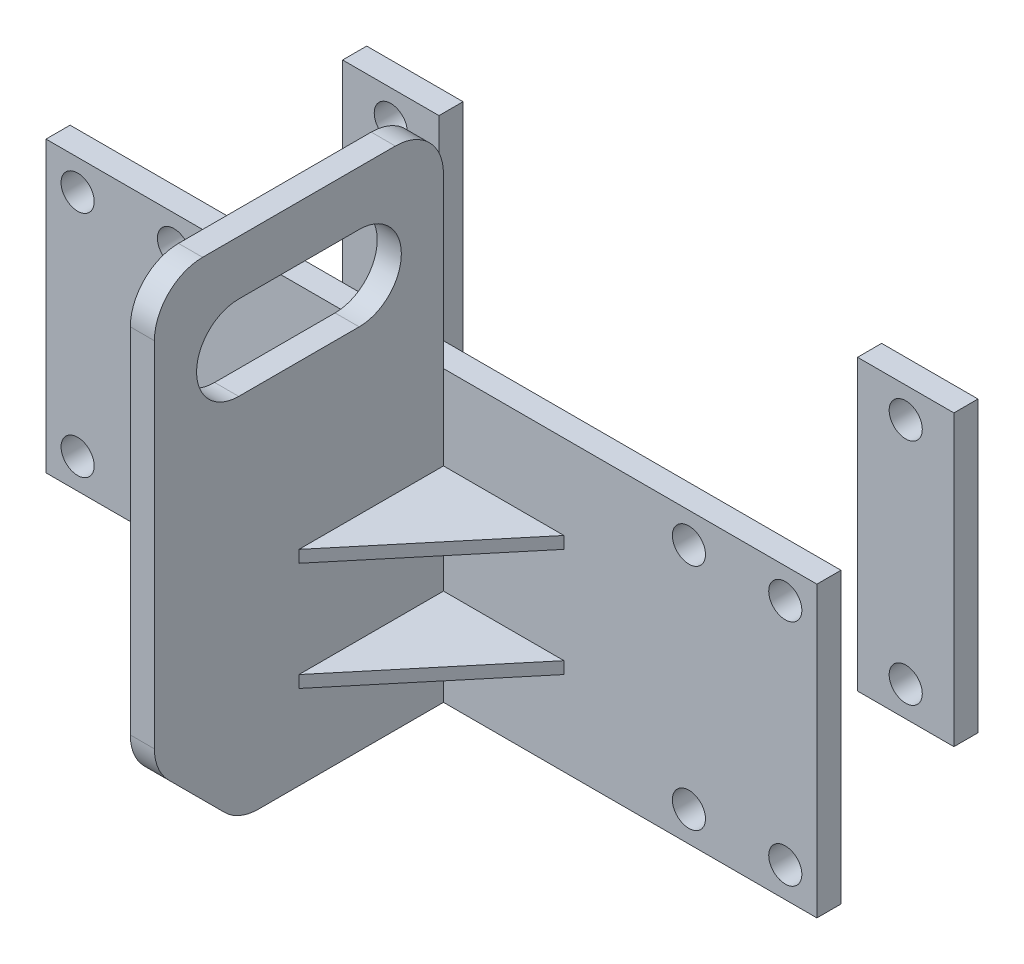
ISO-10303-21;
HEADER;
FILE_DESCRIPTION(('STEP AP214'),'2;1');
FILE_NAME('part.step','',(''),(''),'','','');
FILE_SCHEMA(('AUTOMOTIVE_DESIGN { 1 0 10303 214 1 1 1 1 }'));
ENDSEC;
DATA;
#1=APPLICATION_CONTEXT('core data for automotive mechanical design processes');
#2=APPLICATION_PROTOCOL_DEFINITION('international standard','automotive_design',2000,#1);
#3=PRODUCT_CONTEXT('',#1,'mechanical');
#4=PRODUCT('Part','Part','',(#3));
#5=PRODUCT_RELATED_PRODUCT_CATEGORY('part','',(#4));
#6=PRODUCT_DEFINITION_FORMATION('','',#4);
#7=PRODUCT_DEFINITION_CONTEXT('part definition',#1,'design');
#8=PRODUCT_DEFINITION('design','',#6,#7);
#9=PRODUCT_DEFINITION_SHAPE('','',#8);
#10=(LENGTH_UNIT() NAMED_UNIT(*) SI_UNIT(.MILLI.,.METRE.));
#11=(NAMED_UNIT(*) PLANE_ANGLE_UNIT() SI_UNIT($,.RADIAN.));
#12=(NAMED_UNIT(*) SI_UNIT($,.STERADIAN.) SOLID_ANGLE_UNIT());
#13=UNCERTAINTY_MEASURE_WITH_UNIT(LENGTH_MEASURE(1.E-05),#10,'distance_accuracy_value','');
#14=(GEOMETRIC_REPRESENTATION_CONTEXT(3) GLOBAL_UNCERTAINTY_ASSIGNED_CONTEXT((#13)) GLOBAL_UNIT_ASSIGNED_CONTEXT((#10,
#11,#12)) REPRESENTATION_CONTEXT('',''));
#15=CARTESIAN_POINT('',(0.,0.,0.));
#16=DIRECTION('',(0.,0.,1.));
#17=DIRECTION('',(1.,0.,0.));
#18=AXIS2_PLACEMENT_3D('',#15,#16,#17);
#19=CARTESIAN_POINT('',(-2387.6,0.,393.7));
#20=DIRECTION('',(0.,0.,-1.));
#21=DIRECTION('',(1.,0.,0.));
#22=AXIS2_PLACEMENT_3D('',#19,#20,#21);
#23=PLANE('',#22);
#24=CARTESIAN_POINT('',(-1058.06875,60.325000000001,393.7));
#25=DIRECTION('',(0.,0.,1.));
#26=DIRECTION('',(1.,0.,0.));
#27=AXIS2_PLACEMENT_3D('',#24,#25,#26);
#28=CIRCLE('',#27,8.73125000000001);
#29=CARTESIAN_POINT('',(-1049.3375,60.325000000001,393.7));
#30=VERTEX_POINT('',#29);
#31=EDGE_CURVE('E122',#30,#30,#28,.T.);
#32=ORIENTED_EDGE('',*,*,#31,.T.);
#33=EDGE_LOOP('',(#32));
#34=FACE_BOUND('',#33,.T.);
#35=DIRECTION('',(0.,-1.,0.));
#36=VECTOR('',#35,1.);
#37=CARTESIAN_POINT('',(-1083.46875,76.200000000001,393.7));
#38=LINE('',#37,#36);
#39=CARTESIAN_POINT('',(-1083.46875,76.200000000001,393.7));
#40=VERTEX_POINT('',#39);
#41=CARTESIAN_POINT('',(-1083.46875,-76.199999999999,393.7));
#42=VERTEX_POINT('',#41);
#43=EDGE_CURVE('E110',#40,#42,#38,.T.);
#44=ORIENTED_EDGE('',*,*,#43,.F.);
#45=DIRECTION('',(-1.,0.,0.));
#46=VECTOR('',#45,1.);
#47=CARTESIAN_POINT('',(-1083.46875,76.200000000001,393.7));
#48=LINE('',#47,#46);
#49=CARTESIAN_POINT('',(-1032.66875,76.200000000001,393.7));
#50=VERTEX_POINT('',#49);
#51=EDGE_CURVE('E113',#50,#40,#48,.T.);
#52=ORIENTED_EDGE('',*,*,#51,.F.);
#53=DIRECTION('',(0.,1.,0.));
#54=VECTOR('',#53,1.);
#55=CARTESIAN_POINT('',(-1032.66875,76.200000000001,393.7));
#56=LINE('',#55,#54);
#57=CARTESIAN_POINT('',(-1032.66875,-76.199999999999,393.7));
#58=VERTEX_POINT('',#57);
#59=EDGE_CURVE('E101',#58,#50,#56,.T.);
#60=ORIENTED_EDGE('',*,*,#59,.F.);
#61=DIRECTION('',(1.,0.,0.));
#62=VECTOR('',#61,1.);
#63=CARTESIAN_POINT('',(-1083.46875,-76.199999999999,393.7));
#64=LINE('',#63,#62);
#65=EDGE_CURVE('E106',#42,#58,#64,.T.);
#66=ORIENTED_EDGE('',*,*,#65,.F.);
#67=EDGE_LOOP('',(#44,#52,#60,#66));
#68=FACE_BOUND('',#67,.T.);
#69=CARTESIAN_POINT('',(-1058.06875,-60.324999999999,393.7));
#70=DIRECTION('',(0.,0.,1.));
#71=DIRECTION('',(1.,0.,0.));
#72=AXIS2_PLACEMENT_3D('',#69,#70,#71);
#73=CIRCLE('',#72,8.73125000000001);
#74=CARTESIAN_POINT('',(-1049.3375,-60.324999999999,393.7));
#75=VERTEX_POINT('',#74);
#76=EDGE_CURVE('E133',#75,#75,#73,.T.);
#77=ORIENTED_EDGE('',*,*,#76,.T.);
#78=EDGE_LOOP('',(#77));
#79=FACE_BOUND('',#78,.T.);
#80=ADVANCED_FACE('F54',(#34,#68,#79),#23,.T.);
#81=CARTESIAN_POINT('',(-2387.6,0.,406.4));
#82=DIRECTION('',(0.,0.,-1.));
#83=DIRECTION('',(1.,0.,0.));
#84=AXIS2_PLACEMENT_3D('',#81,#82,#83);
#85=PLANE('',#84);
#86=CARTESIAN_POINT('',(-1058.06875,60.325000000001,406.4));
#87=DIRECTION('',(0.,0.,1.));
#88=DIRECTION('',(1.,0.,0.));
#89=AXIS2_PLACEMENT_3D('',#86,#87,#88);
#90=CIRCLE('',#89,8.73125000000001);
#91=CARTESIAN_POINT('',(-1049.3375,60.325000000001,406.4));
#92=VERTEX_POINT('',#91);
#93=EDGE_CURVE('E130',#92,#92,#90,.T.);
#94=ORIENTED_EDGE('',*,*,#93,.F.);
#95=EDGE_LOOP('',(#94));
#96=FACE_BOUND('',#95,.T.);
#97=DIRECTION('',(0.,-1.,0.));
#98=VECTOR('',#97,1.);
#99=CARTESIAN_POINT('',(-1083.46875,76.200000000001,406.4));
#100=LINE('',#99,#98);
#101=CARTESIAN_POINT('',(-1083.46875,76.200000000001,406.4));
#102=VERTEX_POINT('',#101);
#103=CARTESIAN_POINT('',(-1083.46875,-76.199999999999,406.4));
#104=VERTEX_POINT('',#103);
#105=EDGE_CURVE('E118',#102,#104,#100,.T.);
#106=ORIENTED_EDGE('',*,*,#105,.T.);
#107=DIRECTION('',(1.,0.,0.));
#108=VECTOR('',#107,1.);
#109=CARTESIAN_POINT('',(-1083.46875,-76.199999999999,406.4));
#110=LINE('',#109,#108);
#111=CARTESIAN_POINT('',(-1032.66875,-76.199999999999,406.4));
#112=VERTEX_POINT('',#111);
#113=EDGE_CURVE('E121',#104,#112,#110,.T.);
#114=ORIENTED_EDGE('',*,*,#113,.T.);
#115=DIRECTION('',(0.,1.,0.));
#116=VECTOR('',#115,1.);
#117=CARTESIAN_POINT('',(-1032.66875,76.200000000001,406.4));
#118=LINE('',#117,#116);
#119=CARTESIAN_POINT('',(-1032.66875,76.200000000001,406.4));
#120=VERTEX_POINT('',#119);
#121=EDGE_CURVE('E104',#112,#120,#118,.T.);
#122=ORIENTED_EDGE('',*,*,#121,.T.);
#123=DIRECTION('',(-1.,0.,0.));
#124=VECTOR('',#123,1.);
#125=CARTESIAN_POINT('',(-1083.46875,76.200000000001,406.4));
#126=LINE('',#125,#124);
#127=EDGE_CURVE('E125',#120,#102,#126,.T.);
#128=ORIENTED_EDGE('',*,*,#127,.T.);
#129=EDGE_LOOP('',(#106,#114,#122,#128));
#130=FACE_BOUND('',#129,.T.);
#131=CARTESIAN_POINT('',(-1058.06875,-60.324999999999,406.4));
#132=DIRECTION('',(0.,0.,1.));
#133=DIRECTION('',(1.,0.,0.));
#134=AXIS2_PLACEMENT_3D('',#131,#132,#133);
#135=CIRCLE('',#134,8.73125000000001);
#136=CARTESIAN_POINT('',(-1049.3375,-60.324999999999,406.4));
#137=VERTEX_POINT('',#136);
#138=EDGE_CURVE('E136',#137,#137,#135,.T.);
#139=ORIENTED_EDGE('',*,*,#138,.F.);
#140=EDGE_LOOP('',(#139));
#141=FACE_BOUND('',#140,.T.);
#142=ADVANCED_FACE('F149',(#96,#130,#141),#85,.F.);
#143=CARTESIAN_POINT('',(-1083.46875,76.200000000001,393.7));
#144=DIRECTION('',(1.,0.,0.));
#145=DIRECTION('',(0.,0.,1.));
#146=AXIS2_PLACEMENT_3D('',#143,#144,#145);
#147=PLANE('',#146);
#148=ORIENTED_EDGE('',*,*,#105,.F.);
#149=DIRECTION('',(0.,0.,1.));
#150=VECTOR('',#149,1.);
#151=CARTESIAN_POINT('',(-1083.46875,76.200000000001,393.7));
#152=LINE('',#151,#150);
#153=EDGE_CURVE('E71',#40,#102,#152,.T.);
#154=ORIENTED_EDGE('',*,*,#153,.F.);
#155=ORIENTED_EDGE('',*,*,#43,.T.);
#156=DIRECTION('',(0.,0.,1.));
#157=VECTOR('',#156,1.);
#158=CARTESIAN_POINT('',(-1083.46875,-76.199999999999,393.7));
#159=LINE('',#158,#157);
#160=EDGE_CURVE('E13',#42,#104,#159,.T.);
#161=ORIENTED_EDGE('',*,*,#160,.T.);
#162=EDGE_LOOP('',(#148,#154,#155,#161));
#163=FACE_BOUND('',#162,.T.);
#164=ADVANCED_FACE('F56',(#163),#147,.F.);
#165=CARTESIAN_POINT('',(-1083.46875,-76.199999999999,393.7));
#166=DIRECTION('',(0.,1.,0.));
#167=DIRECTION('',(0.,0.,1.));
#168=AXIS2_PLACEMENT_3D('',#165,#166,#167);
#169=PLANE('',#168);
#170=ORIENTED_EDGE('',*,*,#113,.F.);
#171=ORIENTED_EDGE('',*,*,#160,.F.);
#172=ORIENTED_EDGE('',*,*,#65,.T.);
#173=DIRECTION('',(0.,0.,1.));
#174=VECTOR('',#173,1.);
#175=CARTESIAN_POINT('',(-1032.66875,-76.199999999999,393.7));
#176=LINE('',#175,#174);
#177=EDGE_CURVE('E63',#58,#112,#176,.T.);
#178=ORIENTED_EDGE('',*,*,#177,.T.);
#179=EDGE_LOOP('',(#170,#171,#172,#178));
#180=FACE_BOUND('',#179,.T.);
#181=ADVANCED_FACE('F107',(#180),#169,.F.);
#182=CARTESIAN_POINT('',(-1032.66875,76.200000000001,393.7));
#183=DIRECTION('',(-1.,0.,0.));
#184=DIRECTION('',(0.,0.,-1.));
#185=AXIS2_PLACEMENT_3D('',#182,#183,#184);
#186=PLANE('',#185);
#187=ORIENTED_EDGE('',*,*,#121,.F.);
#188=ORIENTED_EDGE('',*,*,#177,.F.);
#189=ORIENTED_EDGE('',*,*,#59,.T.);
#190=DIRECTION('',(0.,0.,1.));
#191=VECTOR('',#190,1.);
#192=CARTESIAN_POINT('',(-1032.66875,76.200000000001,393.7));
#193=LINE('',#192,#191);
#194=EDGE_CURVE('E87',#50,#120,#193,.T.);
#195=ORIENTED_EDGE('',*,*,#194,.T.);
#196=EDGE_LOOP('',(#187,#188,#189,#195));
#197=FACE_BOUND('',#196,.T.);
#198=ADVANCED_FACE('F99',(#197),#186,.F.);
#199=CARTESIAN_POINT('',(-1083.46875,76.200000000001,393.7));
#200=DIRECTION('',(0.,-1.,0.));
#201=DIRECTION('',(0.,0.,-1.));
#202=AXIS2_PLACEMENT_3D('',#199,#200,#201);
#203=PLANE('',#202);
#204=ORIENTED_EDGE('',*,*,#127,.F.);
#205=ORIENTED_EDGE('',*,*,#194,.F.);
#206=ORIENTED_EDGE('',*,*,#51,.T.);
#207=ORIENTED_EDGE('',*,*,#153,.T.);
#208=EDGE_LOOP('',(#204,#205,#206,#207));
#209=FACE_BOUND('',#208,.T.);
#210=ADVANCED_FACE('F162',(#209),#203,.F.);
#211=CARTESIAN_POINT('',(-1058.06875,60.325000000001,393.7));
#212=DIRECTION('',(0.,0.,1.));
#213=DIRECTION('',(-1.,0.,0.));
#214=AXIS2_PLACEMENT_3D('',#211,#212,#213);
#215=CYLINDRICAL_SURFACE('',#214,8.73125000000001);
#216=ORIENTED_EDGE('',*,*,#31,.F.);
#217=EDGE_LOOP('',(#216));
#218=FACE_BOUND('',#217,.T.);
#219=ORIENTED_EDGE('',*,*,#93,.T.);
#220=EDGE_LOOP('',(#219));
#221=FACE_BOUND('',#220,.T.);
#222=ADVANCED_FACE('F145',(#218,#221),#215,.F.);
#223=CARTESIAN_POINT('',(-1058.06875,-60.324999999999,393.7));
#224=DIRECTION('',(0.,0.,1.));
#225=DIRECTION('',(-1.,0.,0.));
#226=AXIS2_PLACEMENT_3D('',#223,#224,#225);
#227=CYLINDRICAL_SURFACE('',#226,8.73125000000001);
#228=ORIENTED_EDGE('',*,*,#76,.F.);
#229=EDGE_LOOP('',(#228));
#230=FACE_BOUND('',#229,.T.);
#231=ORIENTED_EDGE('',*,*,#138,.T.);
#232=EDGE_LOOP('',(#231));
#233=FACE_BOUND('',#232,.T.);
#234=ADVANCED_FACE('F142',(#230,#233),#227,.F.);
#235=CLOSED_SHELL('',(#80,#142,#164,#181,#198,#210,#222,#234));
#236=MANIFOLD_SOLID_BREP('B2',#235);
#237=CARTESIAN_POINT('',(0.,0.,393.7));
#238=DIRECTION('',(0.,0.,-1.));
#239=DIRECTION('',(-1.,0.,0.));
#240=AXIS2_PLACEMENT_3D('',#237,#238,#239);
#241=PLANE('',#240);
#242=CARTESIAN_POINT('',(-1329.53125,60.325000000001,393.7));
#243=DIRECTION('',(0.,0.,-1.));
#244=DIRECTION('',(-1.,0.,0.));
#245=AXIS2_PLACEMENT_3D('',#242,#243,#244);
#246=CIRCLE('',#245,8.73125000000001);
#247=CARTESIAN_POINT('',(-1338.2625,60.325000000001,393.7));
#248=VERTEX_POINT('',#247);
#249=EDGE_CURVE('E297',#248,#248,#246,.T.);
#250=ORIENTED_EDGE('',*,*,#249,.F.);
#251=EDGE_LOOP('',(#250));
#252=FACE_BOUND('',#251,.T.);
#253=DIRECTION('',(0.,-1.,0.));
#254=VECTOR('',#253,1.);
#255=CARTESIAN_POINT('',(-1304.13125,76.200000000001,393.7));
#256=LINE('',#255,#254);
#257=CARTESIAN_POINT('',(-1304.13125,76.200000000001,393.7));
#258=VERTEX_POINT('',#257);
#259=CARTESIAN_POINT('',(-1304.13125,-76.199999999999,393.7));
#260=VERTEX_POINT('',#259);
#261=EDGE_CURVE('E282',#258,#260,#256,.T.);
#262=ORIENTED_EDGE('',*,*,#261,.T.);
#263=DIRECTION('',(-1.,0.,0.));
#264=VECTOR('',#263,1.);
#265=CARTESIAN_POINT('',(-1304.13125,-76.199999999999,393.7));
#266=LINE('',#265,#264);
#267=CARTESIAN_POINT('',(-1354.93125,-76.199999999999,393.7));
#268=VERTEX_POINT('',#267);
#269=EDGE_CURVE('E277',#260,#268,#266,.T.);
#270=ORIENTED_EDGE('',*,*,#269,.T.);
#271=DIRECTION('',(0.,1.,0.));
#272=VECTOR('',#271,1.);
#273=CARTESIAN_POINT('',(-1354.93125,76.200000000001,393.7));
#274=LINE('',#273,#272);
#275=CARTESIAN_POINT('',(-1354.93125,76.200000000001,393.7));
#276=VERTEX_POINT('',#275);
#277=EDGE_CURVE('E280',#268,#276,#274,.T.);
#278=ORIENTED_EDGE('',*,*,#277,.T.);
#279=DIRECTION('',(1.,0.,0.));
#280=VECTOR('',#279,1.);
#281=CARTESIAN_POINT('',(-1304.13125,76.200000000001,393.7));
#282=LINE('',#281,#280);
#283=EDGE_CURVE('E247',#276,#258,#282,.T.);
#284=ORIENTED_EDGE('',*,*,#283,.T.);
#285=EDGE_LOOP('',(#262,#270,#278,#284));
#286=FACE_BOUND('',#285,.T.);
#287=CARTESIAN_POINT('',(-1329.53125,-60.324999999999,393.7));
#288=DIRECTION('',(0.,0.,-1.));
#289=DIRECTION('',(-1.,0.,0.));
#290=AXIS2_PLACEMENT_3D('',#287,#288,#289);
#291=CIRCLE('',#290,8.73125000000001);
#292=CARTESIAN_POINT('',(-1338.2625,-60.324999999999,393.7));
#293=VERTEX_POINT('',#292);
#294=EDGE_CURVE('E312',#293,#293,#291,.T.);
#295=ORIENTED_EDGE('',*,*,#294,.F.);
#296=EDGE_LOOP('',(#295));
#297=FACE_BOUND('',#296,.T.);
#298=ADVANCED_FACE('F230',(#252,#286,#297),#241,.T.);
#299=CARTESIAN_POINT('',(0.,0.,406.4));
#300=DIRECTION('',(0.,0.,-1.));
#301=DIRECTION('',(-1.,0.,0.));
#302=AXIS2_PLACEMENT_3D('',#299,#300,#301);
#303=PLANE('',#302);
#304=CARTESIAN_POINT('',(-1329.53125,60.325000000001,406.4));
#305=DIRECTION('',(0.,0.,-1.));
#306=DIRECTION('',(-1.,0.,0.));
#307=AXIS2_PLACEMENT_3D('',#304,#305,#306);
#308=CIRCLE('',#307,8.73125000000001);
#309=CARTESIAN_POINT('',(-1338.2625,60.325000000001,406.4));
#310=VERTEX_POINT('',#309);
#311=EDGE_CURVE('E309',#310,#310,#308,.T.);
#312=ORIENTED_EDGE('',*,*,#311,.T.);
#313=EDGE_LOOP('',(#312));
#314=FACE_BOUND('',#313,.T.);
#315=DIRECTION('',(0.,-1.,0.));
#316=VECTOR('',#315,1.);
#317=CARTESIAN_POINT('',(-1304.13125,76.200000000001,406.4));
#318=LINE('',#317,#316);
#319=CARTESIAN_POINT('',(-1304.13125,76.200000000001,406.4));
#320=VERTEX_POINT('',#319);
#321=CARTESIAN_POINT('',(-1304.13125,-76.199999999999,406.4));
#322=VERTEX_POINT('',#321);
#323=EDGE_CURVE('E294',#320,#322,#318,.T.);
#324=ORIENTED_EDGE('',*,*,#323,.F.);
#325=DIRECTION('',(1.,0.,0.));
#326=VECTOR('',#325,1.);
#327=CARTESIAN_POINT('',(-1304.13125,76.200000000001,406.4));
#328=LINE('',#327,#326);
#329=CARTESIAN_POINT('',(-1354.93125,76.200000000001,406.4));
#330=VERTEX_POINT('',#329);
#331=EDGE_CURVE('E270',#330,#320,#328,.T.);
#332=ORIENTED_EDGE('',*,*,#331,.F.);
#333=DIRECTION('',(0.,1.,0.));
#334=VECTOR('',#333,1.);
#335=CARTESIAN_POINT('',(-1354.93125,76.200000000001,406.4));
#336=LINE('',#335,#334);
#337=CARTESIAN_POINT('',(-1354.93125,-76.199999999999,406.4));
#338=VERTEX_POINT('',#337);
#339=EDGE_CURVE('E264',#338,#330,#336,.T.);
#340=ORIENTED_EDGE('',*,*,#339,.F.);
#341=DIRECTION('',(-1.,0.,0.));
#342=VECTOR('',#341,1.);
#343=CARTESIAN_POINT('',(-1304.13125,-76.199999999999,406.4));
#344=LINE('',#343,#342);
#345=EDGE_CURVE('E286',#322,#338,#344,.T.);
#346=ORIENTED_EDGE('',*,*,#345,.F.);
#347=EDGE_LOOP('',(#324,#332,#340,#346));
#348=FACE_BOUND('',#347,.T.);
#349=CARTESIAN_POINT('',(-1329.53125,-60.324999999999,406.4));
#350=DIRECTION('',(0.,0.,-1.));
#351=DIRECTION('',(-1.,0.,0.));
#352=AXIS2_PLACEMENT_3D('',#349,#350,#351);
#353=CIRCLE('',#352,8.73125000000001);
#354=CARTESIAN_POINT('',(-1338.2625,-60.324999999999,406.4));
#355=VERTEX_POINT('',#354);
#356=EDGE_CURVE('E315',#355,#355,#353,.T.);
#357=ORIENTED_EDGE('',*,*,#356,.T.);
#358=EDGE_LOOP('',(#357));
#359=FACE_BOUND('',#358,.T.);
#360=ADVANCED_FACE('F305',(#314,#348,#359),#303,.F.);
#361=CARTESIAN_POINT('',(-1304.13125,76.200000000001,393.7));
#362=DIRECTION('',(-1.,0.,0.));
#363=DIRECTION('',(0.,0.,1.));
#364=AXIS2_PLACEMENT_3D('',#361,#362,#363);
#365=PLANE('',#364);
#366=ORIENTED_EDGE('',*,*,#323,.T.);
#367=DIRECTION('',(0.,0.,1.));
#368=VECTOR('',#367,1.);
#369=CARTESIAN_POINT('',(-1304.13125,-76.199999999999,393.7));
#370=LINE('',#369,#368);
#371=EDGE_CURVE('E52',#260,#322,#370,.T.);
#372=ORIENTED_EDGE('',*,*,#371,.F.);
#373=ORIENTED_EDGE('',*,*,#261,.F.);
#374=DIRECTION('',(0.,0.,1.));
#375=VECTOR('',#374,1.);
#376=CARTESIAN_POINT('',(-1304.13125,76.200000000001,393.7));
#377=LINE('',#376,#375);
#378=EDGE_CURVE('E290',#258,#320,#377,.T.);
#379=ORIENTED_EDGE('',*,*,#378,.T.);
#380=EDGE_LOOP('',(#366,#372,#373,#379));
#381=FACE_BOUND('',#380,.T.);
#382=ADVANCED_FACE('F232',(#381),#365,.F.);
#383=CARTESIAN_POINT('',(-1304.13125,-76.199999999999,393.7));
#384=DIRECTION('',(0.,1.,0.));
#385=DIRECTION('',(0.,0.,1.));
#386=AXIS2_PLACEMENT_3D('',#383,#384,#385);
#387=PLANE('',#386);
#388=ORIENTED_EDGE('',*,*,#345,.T.);
#389=DIRECTION('',(0.,0.,1.));
#390=VECTOR('',#389,1.);
#391=CARTESIAN_POINT('',(-1354.93125,-76.199999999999,393.7));
#392=LINE('',#391,#390);
#393=EDGE_CURVE('E239',#268,#338,#392,.T.);
#394=ORIENTED_EDGE('',*,*,#393,.F.);
#395=ORIENTED_EDGE('',*,*,#269,.F.);
#396=ORIENTED_EDGE('',*,*,#371,.T.);
#397=EDGE_LOOP('',(#388,#394,#395,#396));
#398=FACE_BOUND('',#397,.T.);
#399=ADVANCED_FACE('F285',(#398),#387,.F.);
#400=CARTESIAN_POINT('',(-1354.93125,76.200000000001,393.7));
#401=DIRECTION('',(1.,0.,0.));
#402=DIRECTION('',(0.,0.,-1.));
#403=AXIS2_PLACEMENT_3D('',#400,#401,#402);
#404=PLANE('',#403);
#405=ORIENTED_EDGE('',*,*,#339,.T.);
#406=DIRECTION('',(0.,0.,1.));
#407=VECTOR('',#406,1.);
#408=CARTESIAN_POINT('',(-1354.93125,76.200000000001,393.7));
#409=LINE('',#408,#407);
#410=EDGE_CURVE('E287',#276,#330,#409,.T.);
#411=ORIENTED_EDGE('',*,*,#410,.F.);
#412=ORIENTED_EDGE('',*,*,#277,.F.);
#413=ORIENTED_EDGE('',*,*,#393,.T.);
#414=EDGE_LOOP('',(#405,#411,#412,#413));
#415=FACE_BOUND('',#414,.T.);
#416=ADVANCED_FACE('F288',(#415),#404,.F.);
#417=CARTESIAN_POINT('',(-1304.13125,76.200000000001,393.7));
#418=DIRECTION('',(0.,-1.,0.));
#419=DIRECTION('',(0.,0.,-1.));
#420=AXIS2_PLACEMENT_3D('',#417,#418,#419);
#421=PLANE('',#420);
#422=ORIENTED_EDGE('',*,*,#331,.T.);
#423=ORIENTED_EDGE('',*,*,#378,.F.);
#424=ORIENTED_EDGE('',*,*,#283,.F.);
#425=ORIENTED_EDGE('',*,*,#410,.T.);
#426=EDGE_LOOP('',(#422,#423,#424,#425));
#427=FACE_BOUND('',#426,.T.);
#428=ADVANCED_FACE('F302',(#427),#421,.F.);
#429=CARTESIAN_POINT('',(-1329.53125,60.325000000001,393.7));
#430=DIRECTION('',(0.,0.,1.));
#431=DIRECTION('',(1.,0.,0.));
#432=AXIS2_PLACEMENT_3D('',#429,#430,#431);
#433=CYLINDRICAL_SURFACE('',#432,8.73125000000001);
#434=ORIENTED_EDGE('',*,*,#249,.T.);
#435=EDGE_LOOP('',(#434));
#436=FACE_BOUND('',#435,.T.);
#437=ORIENTED_EDGE('',*,*,#311,.F.);
#438=EDGE_LOOP('',(#437));
#439=FACE_BOUND('',#438,.T.);
#440=ADVANCED_FACE('F333',(#436,#439),#433,.F.);
#441=CARTESIAN_POINT('',(-1329.53125,-60.324999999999,393.7));
#442=DIRECTION('',(0.,0.,1.));
#443=DIRECTION('',(1.,0.,0.));
#444=AXIS2_PLACEMENT_3D('',#441,#442,#443);
#445=CYLINDRICAL_SURFACE('',#444,8.73125000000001);
#446=ORIENTED_EDGE('',*,*,#294,.T.);
#447=EDGE_LOOP('',(#446));
#448=FACE_BOUND('',#447,.T.);
#449=ORIENTED_EDGE('',*,*,#356,.F.);
#450=EDGE_LOOP('',(#449));
#451=FACE_BOUND('',#450,.T.);
#452=ADVANCED_FACE('F321',(#448,#451),#445,.F.);
#453=CLOSED_SHELL('',(#298,#360,#382,#399,#416,#428,#440,#452));
#454=MANIFOLD_SOLID_BREP('B7',#453);
#455=CARTESIAN_POINT('',(-1417.32,-69.849999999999,520.7));
#456=DIRECTION('',(0.,0.,1.));
#457=DIRECTION('',(1.,0.,0.));
#458=AXIS2_PLACEMENT_3D('',#455,#456,#457);
#459=PLANE('',#458);
#460=CARTESIAN_POINT('',(-1380.33125,-60.324999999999,520.7));
#461=DIRECTION('',(0.,0.,-1.));
#462=DIRECTION('',(-1.,0.,0.));
#463=AXIS2_PLACEMENT_3D('',#460,#461,#462);
#464=CIRCLE('',#463,8.73125000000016);
#465=CARTESIAN_POINT('',(-1389.0625,-60.324999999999,520.7));
#466=VERTEX_POINT('',#465);
#467=EDGE_CURVE('E794',#466,#466,#464,.F.);
#468=ORIENTED_EDGE('',*,*,#467,.F.);
#469=EDGE_LOOP('',(#468));
#470=FACE_BOUND('',#469,.T.);
#471=CARTESIAN_POINT('',(-1380.33125,60.325000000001,520.7));
#472=DIRECTION('',(0.,0.,-1.));
#473=DIRECTION('',(-1.,0.,0.));
#474=AXIS2_PLACEMENT_3D('',#471,#472,#473);
#475=CIRCLE('',#474,8.73125000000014);
#476=CARTESIAN_POINT('',(-1389.0625,60.325000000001,520.7));
#477=VERTEX_POINT('',#476);
#478=EDGE_CURVE('E791',#477,#477,#475,.F.);
#479=ORIENTED_EDGE('',*,*,#478,.F.);
#480=EDGE_LOOP('',(#479));
#481=FACE_BOUND('',#480,.T.);
#482=CARTESIAN_POINT('',(-1329.53125,60.325000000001,520.7));
#483=DIRECTION('',(0.,0.,-1.));
#484=DIRECTION('',(-1.,0.,0.));
#485=AXIS2_PLACEMENT_3D('',#482,#483,#484);
#486=CIRCLE('',#485,8.73125000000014);
#487=CARTESIAN_POINT('',(-1338.2625,60.325000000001,520.7));
#488=VERTEX_POINT('',#487);
#489=EDGE_CURVE('E800',#488,#488,#486,.F.);
#490=ORIENTED_EDGE('',*,*,#489,.F.);
#491=EDGE_LOOP('',(#490));
#492=FACE_BOUND('',#491,.T.);
#493=CARTESIAN_POINT('',(-1329.53125,-60.324999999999,520.7));
#494=DIRECTION('',(0.,0.,-1.));
#495=DIRECTION('',(-1.,0.,0.));
#496=AXIS2_PLACEMENT_3D('',#493,#494,#495);
#497=CIRCLE('',#496,8.73125000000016);
#498=CARTESIAN_POINT('',(-1338.2625,-60.324999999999,520.7));
#499=VERTEX_POINT('',#498);
#500=EDGE_CURVE('E785',#499,#499,#497,.F.);
#501=ORIENTED_EDGE('',*,*,#500,.F.);
#502=EDGE_LOOP('',(#501));
#503=FACE_BOUND('',#502,.T.);
#504=DIRECTION('',(-1.,0.,0.));
#505=VECTOR('',#504,1.);
#506=CARTESIAN_POINT('',(-1193.8,25.400000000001,520.7));
#507=LINE('',#506,#505);
#508=CARTESIAN_POINT('',(-1200.15,25.400000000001,520.7));
#509=VERTEX_POINT('',#508);
#510=CARTESIAN_POINT('',(-1263.65,25.399999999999,520.7));
#511=VERTEX_POINT('',#510);
#512=EDGE_CURVE('E712',#509,#511,#507,.T.);
#513=ORIENTED_EDGE('',*,*,#512,.T.);
#514=DIRECTION('',(0.,1.,0.));
#515=VECTOR('',#514,1.);
#516=CARTESIAN_POINT('',(-1263.65,25.399999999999,520.7));
#517=LINE('',#516,#515);
#518=CARTESIAN_POINT('',(-1263.65,31.749999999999,520.7));
#519=VERTEX_POINT('',#518);
#520=EDGE_CURVE('E650',#511,#519,#517,.T.);
#521=ORIENTED_EDGE('',*,*,#520,.T.);
#522=DIRECTION('',(1.,0.,0.));
#523=VECTOR('',#522,1.);
#524=CARTESIAN_POINT('',(-1193.8,31.750000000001,520.7));
#525=LINE('',#524,#523);
#526=CARTESIAN_POINT('',(-1200.15,31.750000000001,520.7));
#527=VERTEX_POINT('',#526);
#528=EDGE_CURVE('E711',#519,#527,#525,.T.);
#529=ORIENTED_EDGE('',*,*,#528,.T.);
#530=DIRECTION('',(0.,1.,0.));
#531=VECTOR('',#530,1.);
#532=CARTESIAN_POINT('',(-1200.15,9.85322934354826E-13,520.7));
#533=LINE('',#532,#531);
#534=CARTESIAN_POINT('',(-1200.15,76.200000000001,520.7));
#535=VERTEX_POINT('',#534);
#536=EDGE_CURVE('E709',#527,#535,#533,.T.);
#537=ORIENTED_EDGE('',*,*,#536,.T.);
#538=DIRECTION('',(1.,0.,0.));
#539=VECTOR('',#538,1.);
#540=CARTESIAN_POINT('',(-1193.8,76.200000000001,520.7));
#541=LINE('',#540,#539);
#542=CARTESIAN_POINT('',(-1397.,76.200000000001,520.7));
#543=VERTEX_POINT('',#542);
#544=EDGE_CURVE('E631',#543,#535,#541,.T.);
#545=ORIENTED_EDGE('',*,*,#544,.F.);
#546=DIRECTION('',(0.,1.,0.));
#547=VECTOR('',#546,1.);
#548=CARTESIAN_POINT('',(-1397.,1.00613961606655E-12,520.7));
#549=LINE('',#548,#547);
#550=CARTESIAN_POINT('',(-1397.,-76.199999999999,520.7));
#551=VERTEX_POINT('',#550);
#552=EDGE_CURVE('E690',#551,#543,#549,.T.);
#553=ORIENTED_EDGE('',*,*,#552,.F.);
#554=DIRECTION('',(-1.,0.,0.));
#555=VECTOR('',#554,1.);
#556=CARTESIAN_POINT('',(-1193.8,-76.199999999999,520.7));
#557=LINE('',#556,#555);
#558=CARTESIAN_POINT('',(-1200.15,-76.199999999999,520.7));
#559=VERTEX_POINT('',#558);
#560=EDGE_CURVE('E816',#559,#551,#557,.T.);
#561=ORIENTED_EDGE('',*,*,#560,.F.);
#562=DIRECTION('',(0.,1.,0.));
#563=VECTOR('',#562,1.);
#564=CARTESIAN_POINT('',(-1200.15,9.85322934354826E-13,520.7));
#565=LINE('',#564,#563);
#566=CARTESIAN_POINT('',(-1200.15,-31.749999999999,520.7));
#567=VERTEX_POINT('',#566);
#568=EDGE_CURVE('E706',#559,#567,#565,.T.);
#569=ORIENTED_EDGE('',*,*,#568,.T.);
#570=DIRECTION('',(-1.,0.,0.));
#571=VECTOR('',#570,1.);
#572=CARTESIAN_POINT('',(-1193.8,-31.749999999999,520.7));
#573=LINE('',#572,#571);
#574=CARTESIAN_POINT('',(-1263.65,-31.749999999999,520.7));
#575=VERTEX_POINT('',#574);
#576=EDGE_CURVE('E704',#567,#575,#573,.T.);
#577=ORIENTED_EDGE('',*,*,#576,.T.);
#578=DIRECTION('',(0.,-1.,0.));
#579=VECTOR('',#578,1.);
#580=CARTESIAN_POINT('',(-1263.65,-25.399999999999,520.7));
#581=LINE('',#580,#579);
#582=CARTESIAN_POINT('',(-1263.65,-25.399999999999,520.7));
#583=VERTEX_POINT('',#582);
#584=EDGE_CURVE('E666',#583,#575,#581,.T.);
#585=ORIENTED_EDGE('',*,*,#584,.F.);
#586=DIRECTION('',(1.,0.,0.));
#587=VECTOR('',#586,1.);
#588=CARTESIAN_POINT('',(-1193.8,-25.399999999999,520.7));
#589=LINE('',#588,#587);
#590=CARTESIAN_POINT('',(-1200.15,-25.399999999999,520.7));
#591=VERTEX_POINT('',#590);
#592=EDGE_CURVE('E717',#583,#591,#589,.T.);
#593=ORIENTED_EDGE('',*,*,#592,.T.);
#594=DIRECTION('',(0.,1.,0.));
#595=VECTOR('',#594,1.);
#596=CARTESIAN_POINT('',(-1200.15,9.85322934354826E-13,520.7));
#597=LINE('',#596,#595);
#598=EDGE_CURVE('E714',#591,#509,#597,.T.);
#599=ORIENTED_EDGE('',*,*,#598,.T.);
#600=EDGE_LOOP('',(#513,#521,#529,#537,#545,#553,#561,#569,#577,#585,#593,#599));
#601=FACE_BOUND('',#600,.T.);
#602=ADVANCED_FACE('F398',(#470,#481,#492,#503,#601),#459,.T.);
#603=CARTESIAN_POINT('',(-1417.32,-69.849999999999,520.7));
#604=DIRECTION('',(0.,0.,1.));
#605=DIRECTION('',(1.,0.,0.));
#606=AXIS2_PLACEMENT_3D('',#603,#604,#605);
#607=PLANE('',#606);
#608=CARTESIAN_POINT('',(-1007.26875,60.325000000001,520.7));
#609=DIRECTION('',(0.,0.,-1.));
#610=DIRECTION('',(-1.,0.,0.));
#611=AXIS2_PLACEMENT_3D('',#608,#609,#610);
#612=CIRCLE('',#611,8.73125000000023);
#613=CARTESIAN_POINT('',(-1016.,60.325000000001,520.7));
#614=VERTEX_POINT('',#613);
#615=EDGE_CURVE('E689',#614,#614,#612,.F.);
#616=ORIENTED_EDGE('',*,*,#615,.F.);
#617=EDGE_LOOP('',(#616));
#618=FACE_BOUND('',#617,.T.);
#619=CARTESIAN_POINT('',(-1007.26875,-60.324999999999,520.7));
#620=DIRECTION('',(0.,0.,-1.));
#621=DIRECTION('',(-1.,0.,0.));
#622=AXIS2_PLACEMENT_3D('',#619,#620,#621);
#623=CIRCLE('',#622,8.73125000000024);
#624=CARTESIAN_POINT('',(-1016.,-60.324999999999,520.7));
#625=VERTEX_POINT('',#624);
#626=EDGE_CURVE('E777',#625,#625,#623,.F.);
#627=ORIENTED_EDGE('',*,*,#626,.F.);
#628=EDGE_LOOP('',(#627));
#629=FACE_BOUND('',#628,.T.);
#630=CARTESIAN_POINT('',(-1058.06875,-60.324999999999,520.7));
#631=DIRECTION('',(0.,0.,-1.));
#632=DIRECTION('',(-1.,0.,0.));
#633=AXIS2_PLACEMENT_3D('',#630,#631,#632);
#634=CIRCLE('',#633,8.73125000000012);
#635=CARTESIAN_POINT('',(-1066.8,-60.324999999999,520.7));
#636=VERTEX_POINT('',#635);
#637=EDGE_CURVE('E795',#636,#636,#634,.F.);
#638=ORIENTED_EDGE('',*,*,#637,.F.);
#639=EDGE_LOOP('',(#638));
#640=FACE_BOUND('',#639,.T.);
#641=CARTESIAN_POINT('',(-1058.06875,60.325000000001,520.7));
#642=DIRECTION('',(0.,0.,-1.));
#643=DIRECTION('',(-1.,0.,0.));
#644=AXIS2_PLACEMENT_3D('',#641,#642,#643);
#645=CIRCLE('',#644,8.73125000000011);
#646=CARTESIAN_POINT('',(-1066.8,60.325000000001,520.7));
#647=VERTEX_POINT('',#646);
#648=EDGE_CURVE('E803',#647,#647,#645,.F.);
#649=ORIENTED_EDGE('',*,*,#648,.F.);
#650=EDGE_LOOP('',(#649));
#651=FACE_BOUND('',#650,.T.);
#652=DIRECTION('',(0.,1.,0.));
#653=VECTOR('',#652,1.);
#654=CARTESIAN_POINT('',(-1123.95,25.399999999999,520.7));
#655=LINE('',#654,#653);
#656=CARTESIAN_POINT('',(-1123.95,25.399999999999,520.7));
#657=VERTEX_POINT('',#656);
#658=CARTESIAN_POINT('',(-1123.95,31.749999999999,520.7));
#659=VERTEX_POINT('',#658);
#660=EDGE_CURVE('E658',#657,#659,#655,.T.);
#661=ORIENTED_EDGE('',*,*,#660,.F.);
#662=DIRECTION('',(-1.,0.,0.));
#663=VECTOR('',#662,1.);
#664=CARTESIAN_POINT('',(-1193.8,25.400000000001,520.7));
#665=LINE('',#664,#663);
#666=CARTESIAN_POINT('',(-1187.45,25.400000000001,520.7));
#667=VERTEX_POINT('',#666);
#668=EDGE_CURVE('E698',#657,#667,#665,.T.);
#669=ORIENTED_EDGE('',*,*,#668,.T.);
#670=DIRECTION('',(0.,-1.,0.));
#671=VECTOR('',#670,1.);
#672=CARTESIAN_POINT('',(-1187.45,9.92261828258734E-13,520.7));
#673=LINE('',#672,#671);
#674=CARTESIAN_POINT('',(-1187.45,-25.399999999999,520.7));
#675=VERTEX_POINT('',#674);
#676=EDGE_CURVE('E695',#667,#675,#673,.T.);
#677=ORIENTED_EDGE('',*,*,#676,.T.);
#678=DIRECTION('',(1.,0.,0.));
#679=VECTOR('',#678,1.);
#680=CARTESIAN_POINT('',(-1193.8,-25.399999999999,520.7));
#681=LINE('',#680,#679);
#682=CARTESIAN_POINT('',(-1123.95,-25.399999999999,520.7));
#683=VERTEX_POINT('',#682);
#684=EDGE_CURVE('E702',#675,#683,#681,.T.);
#685=ORIENTED_EDGE('',*,*,#684,.T.);
#686=DIRECTION('',(0.,-1.,0.));
#687=VECTOR('',#686,1.);
#688=CARTESIAN_POINT('',(-1123.95,-25.399999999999,520.7));
#689=LINE('',#688,#687);
#690=CARTESIAN_POINT('',(-1123.95,-31.749999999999,520.7));
#691=VERTEX_POINT('',#690);
#692=EDGE_CURVE('E675',#683,#691,#689,.T.);
#693=ORIENTED_EDGE('',*,*,#692,.T.);
#694=DIRECTION('',(-1.,0.,0.));
#695=VECTOR('',#694,1.);
#696=CARTESIAN_POINT('',(-1193.8,-31.749999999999,520.7));
#697=LINE('',#696,#695);
#698=CARTESIAN_POINT('',(-1187.45,-31.749999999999,520.7));
#699=VERTEX_POINT('',#698);
#700=EDGE_CURVE('E701',#691,#699,#697,.T.);
#701=ORIENTED_EDGE('',*,*,#700,.T.);
#702=DIRECTION('',(0.,-1.,0.));
#703=VECTOR('',#702,1.);
#704=CARTESIAN_POINT('',(-1187.45,9.92261828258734E-13,520.7));
#705=LINE('',#704,#703);
#706=CARTESIAN_POINT('',(-1187.45,-76.199999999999,520.7));
#707=VERTEX_POINT('',#706);
#708=EDGE_CURVE('E623',#699,#707,#705,.T.);
#709=ORIENTED_EDGE('',*,*,#708,.T.);
#710=DIRECTION('',(-1.,0.,0.));
#711=VECTOR('',#710,1.);
#712=CARTESIAN_POINT('',(-1193.8,-76.199999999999,520.7));
#713=LINE('',#712,#711);
#714=CARTESIAN_POINT('',(-990.6,-76.199999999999,520.7));
#715=VERTEX_POINT('',#714);
#716=EDGE_CURVE('E810',#715,#707,#713,.T.);
#717=ORIENTED_EDGE('',*,*,#716,.F.);
#718=DIRECTION('',(0.,-1.,0.));
#719=VECTOR('',#718,1.);
#720=CARTESIAN_POINT('',(-990.6,1.00613961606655E-12,520.7));
#721=LINE('',#720,#719);
#722=CARTESIAN_POINT('',(-990.6,76.200000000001,520.7));
#723=VERTEX_POINT('',#722);
#724=EDGE_CURVE('E603',#723,#715,#721,.T.);
#725=ORIENTED_EDGE('',*,*,#724,.F.);
#726=DIRECTION('',(1.,0.,0.));
#727=VECTOR('',#726,1.);
#728=CARTESIAN_POINT('',(-1193.8,76.200000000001,520.7));
#729=LINE('',#728,#727);
#730=CARTESIAN_POINT('',(-1187.45,76.200000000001,520.7));
#731=VERTEX_POINT('',#730);
#732=EDGE_CURVE('E597',#731,#723,#729,.T.);
#733=ORIENTED_EDGE('',*,*,#732,.F.);
#734=DIRECTION('',(0.,-1.,0.));
#735=VECTOR('',#734,1.);
#736=CARTESIAN_POINT('',(-1187.45,9.92261828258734E-13,520.7));
#737=LINE('',#736,#735);
#738=CARTESIAN_POINT('',(-1187.45,31.750000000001,520.7));
#739=VERTEX_POINT('',#738);
#740=EDGE_CURVE('E601',#731,#739,#737,.T.);
#741=ORIENTED_EDGE('',*,*,#740,.T.);
#742=DIRECTION('',(1.,0.,0.));
#743=VECTOR('',#742,1.);
#744=CARTESIAN_POINT('',(-1193.8,31.750000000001,520.7));
#745=LINE('',#744,#743);
#746=EDGE_CURVE('E622',#739,#659,#745,.T.);
#747=ORIENTED_EDGE('',*,*,#746,.T.);
#748=EDGE_LOOP('',(#661,#669,#677,#685,#693,#701,#709,#717,#725,#733,#741,#747));
#749=FACE_BOUND('',#748,.T.);
#750=ADVANCED_FACE('F600',(#618,#629,#640,#651,#749),#607,.T.);
#751=CARTESIAN_POINT('',(-1200.15,31.750000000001,673.1));
#752=DIRECTION('',(0.,0.,1.));
#753=DIRECTION('',(0.,-1.,0.));
#754=AXIS2_PLACEMENT_3D('',#751,#752,#753);
#755=PLANE('',#754);
#756=DIRECTION('',(0.,1.,0.));
#757=VECTOR('',#756,1.);
#758=CARTESIAN_POINT('',(-1200.15,9.92261828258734E-13,673.1));
#759=LINE('',#758,#757);
#760=CARTESIAN_POINT('',(-1200.15,-21.2289755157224,673.1));
#761=VERTEX_POINT('',#760);
#762=CARTESIAN_POINT('',(-1200.15,165.100000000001,673.1));
#763=VERTEX_POINT('',#762);
#764=EDGE_CURVE('E747',#761,#763,#759,.T.);
#765=ORIENTED_EDGE('',*,*,#764,.F.);
#766=DIRECTION('',(-1.,0.,0.));
#767=VECTOR('',#766,1.);
#768=CARTESIAN_POINT('',(-1200.15,-21.2289755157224,673.1));
#769=LINE('',#768,#767);
#770=CARTESIAN_POINT('',(-1187.45,-21.2289755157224,673.1));
#771=VERTEX_POINT('',#770);
#772=EDGE_CURVE('E420',#761,#771,#769,.F.);
#773=ORIENTED_EDGE('',*,*,#772,.T.);
#774=DIRECTION('',(0.,-1.,0.));
#775=VECTOR('',#774,1.);
#776=CARTESIAN_POINT('',(-1187.45,9.92261828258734E-13,673.1));
#777=LINE('',#776,#775);
#778=CARTESIAN_POINT('',(-1187.45,165.100000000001,673.1));
#779=VERTEX_POINT('',#778);
#780=EDGE_CURVE('E722',#779,#771,#777,.T.);
#781=ORIENTED_EDGE('',*,*,#780,.F.);
#782=DIRECTION('',(1.,0.,0.));
#783=VECTOR('',#782,1.);
#784=CARTESIAN_POINT('',(-1200.15,165.100000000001,673.1));
#785=LINE('',#784,#783);
#786=EDGE_CURVE('E890',#779,#763,#785,.F.);
#787=ORIENTED_EDGE('',*,*,#786,.T.);
#788=EDGE_LOOP('',(#765,#773,#781,#787));
#789=FACE_BOUND('',#788,.T.);
#790=ADVANCED_FACE('F905',(#789),#755,.T.);
#791=CARTESIAN_POINT('',(-1200.15,139.699999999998,565.15));
#792=DIRECTION('',(1.,1.29879858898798E-13,-1.29879858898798E-13));
#793=DIRECTION('',(-1.29879858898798E-13,0.,-1.));
#794=AXIS2_PLACEMENT_3D('',#791,#792,#793);
#795=CYLINDRICAL_SURFACE('',#794,22.2250000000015);
#796=CARTESIAN_POINT('',(-1187.45,139.699999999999,565.149999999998));
#797=DIRECTION('',(1.,1.29879858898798E-13,-1.29879858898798E-13));
#798=DIRECTION('',(-1.29879858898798E-13,0.,-1.));
#799=AXIS2_PLACEMENT_3D('',#796,#797,#798);
#800=CIRCLE('',#799,22.2250000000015);
#801=CARTESIAN_POINT('',(-1187.45,161.925000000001,565.149999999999));
#802=VERTEX_POINT('',#801);
#803=CARTESIAN_POINT('',(-1187.45,117.475000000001,565.149999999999));
#804=VERTEX_POINT('',#803);
#805=EDGE_CURVE('E753',#802,#804,#800,.F.);
#806=ORIENTED_EDGE('',*,*,#805,.F.);
#807=DIRECTION('',(1.,0.,0.));
#808=VECTOR('',#807,1.);
#809=CARTESIAN_POINT('',(-1193.8,161.925000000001,565.15));
#810=LINE('',#809,#808);
#811=CARTESIAN_POINT('',(-1200.15,161.925000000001,565.15));
#812=VERTEX_POINT('',#811);
#813=EDGE_CURVE('E844',#812,#802,#810,.T.);
#814=ORIENTED_EDGE('',*,*,#813,.F.);
#815=CARTESIAN_POINT('',(-1200.15,139.699999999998,565.15));
#816=DIRECTION('',(1.,1.29879858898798E-13,-1.29879858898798E-13));
#817=DIRECTION('',(-1.29879858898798E-13,0.,-1.));
#818=AXIS2_PLACEMENT_3D('',#815,#816,#817);
#819=CIRCLE('',#818,22.2250000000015);
#820=CARTESIAN_POINT('',(-1200.15,117.475000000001,565.15));
#821=VERTEX_POINT('',#820);
#822=EDGE_CURVE('E860',#821,#812,#819,.T.);
#823=ORIENTED_EDGE('',*,*,#822,.F.);
#824=DIRECTION('',(-1.,0.,0.));
#825=VECTOR('',#824,1.);
#826=CARTESIAN_POINT('',(-1193.8,117.475000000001,565.15));
#827=LINE('',#826,#825);
#828=EDGE_CURVE('E680',#804,#821,#827,.T.);
#829=ORIENTED_EDGE('',*,*,#828,.F.);
#830=EDGE_LOOP('',(#806,#814,#823,#829));
#831=FACE_BOUND('',#830,.T.);
#832=ADVANCED_FACE('F1022',(#831),#795,.F.);
#833=CARTESIAN_POINT('',(-1200.15,117.475000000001,565.15));
#834=DIRECTION('',(0.,1.,0.));
#835=DIRECTION('',(0.,0.,1.));
#836=AXIS2_PLACEMENT_3D('',#833,#834,#835);
#837=PLANE('',#836);
#838=DIRECTION('',(0.,0.,1.));
#839=VECTOR('',#838,1.);
#840=CARTESIAN_POINT('',(-1187.45,117.475000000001,596.9));
#841=LINE('',#840,#839);
#842=CARTESIAN_POINT('',(-1187.45,117.475000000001,628.65));
#843=VERTEX_POINT('',#842);
#844=EDGE_CURVE('E848',#804,#843,#841,.T.);
#845=ORIENTED_EDGE('',*,*,#844,.F.);
#846=ORIENTED_EDGE('',*,*,#828,.T.);
#847=DIRECTION('',(0.,0.,-1.));
#848=VECTOR('',#847,1.);
#849=CARTESIAN_POINT('',(-1200.15,117.475000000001,596.9));
#850=LINE('',#849,#848);
#851=CARTESIAN_POINT('',(-1200.15,117.475000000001,628.65));
#852=VERTEX_POINT('',#851);
#853=EDGE_CURVE('E731',#852,#821,#850,.T.);
#854=ORIENTED_EDGE('',*,*,#853,.F.);
#855=DIRECTION('',(-1.,0.,0.));
#856=VECTOR('',#855,1.);
#857=CARTESIAN_POINT('',(-1193.8,117.475000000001,628.65));
#858=LINE('',#857,#856);
#859=EDGE_CURVE('E841',#843,#852,#858,.T.);
#860=ORIENTED_EDGE('',*,*,#859,.F.);
#861=EDGE_LOOP('',(#845,#846,#854,#860));
#862=FACE_BOUND('',#861,.T.);
#863=ADVANCED_FACE('F1018',(#862),#837,.T.);
#864=CARTESIAN_POINT('',(-1200.15,139.699999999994,628.65));
#865=DIRECTION('',(1.,0.,0.));
#866=DIRECTION('',(0.,0.,-1.));
#867=AXIS2_PLACEMENT_3D('',#864,#865,#866);
#868=CYLINDRICAL_SURFACE('',#867,22.2249999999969);
#869=CARTESIAN_POINT('',(-1187.45,139.699999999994,628.65));
#870=DIRECTION('',(1.,0.,0.));
#871=DIRECTION('',(0.,0.,-1.));
#872=AXIS2_PLACEMENT_3D('',#869,#870,#871);
#873=CIRCLE('',#872,22.2249999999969);
#874=CARTESIAN_POINT('',(-1187.45,161.925000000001,628.65));
#875=VERTEX_POINT('',#874);
#876=EDGE_CURVE('E851',#843,#875,#873,.F.);
#877=ORIENTED_EDGE('',*,*,#876,.F.);
#878=ORIENTED_EDGE('',*,*,#859,.T.);
#879=CARTESIAN_POINT('',(-1200.15,139.699999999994,628.65));
#880=DIRECTION('',(1.,0.,0.));
#881=DIRECTION('',(0.,0.,-1.));
#882=AXIS2_PLACEMENT_3D('',#879,#880,#881);
#883=CIRCLE('',#882,22.2249999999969);
#884=CARTESIAN_POINT('',(-1200.15,161.925000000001,628.65));
#885=VERTEX_POINT('',#884);
#886=EDGE_CURVE('E728',#885,#852,#883,.T.);
#887=ORIENTED_EDGE('',*,*,#886,.F.);
#888=DIRECTION('',(-1.,0.,0.));
#889=VECTOR('',#888,1.);
#890=CARTESIAN_POINT('',(-1193.8,161.925000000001,628.65));
#891=LINE('',#890,#889);
#892=EDGE_CURVE('E741',#875,#885,#891,.T.);
#893=ORIENTED_EDGE('',*,*,#892,.F.);
#894=EDGE_LOOP('',(#877,#878,#887,#893));
#895=FACE_BOUND('',#894,.T.);
#896=ADVANCED_FACE('F1021',(#895),#868,.F.);
#897=CARTESIAN_POINT('',(-1200.15,161.925000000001,628.65));
#898=DIRECTION('',(0.,-1.,0.));
#899=DIRECTION('',(0.,0.,-1.));
#900=AXIS2_PLACEMENT_3D('',#897,#898,#899);
#901=PLANE('',#900);
#902=DIRECTION('',(0.,0.,-1.));
#903=VECTOR('',#902,1.);
#904=CARTESIAN_POINT('',(-1187.45,161.925000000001,596.9));
#905=LINE('',#904,#903);
#906=EDGE_CURVE('E720',#875,#802,#905,.T.);
#907=ORIENTED_EDGE('',*,*,#906,.F.);
#908=ORIENTED_EDGE('',*,*,#892,.T.);
#909=DIRECTION('',(0.,0.,1.));
#910=VECTOR('',#909,1.);
#911=CARTESIAN_POINT('',(-1200.15,161.925000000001,596.9));
#912=LINE('',#911,#910);
#913=EDGE_CURVE('E863',#812,#885,#912,.T.);
#914=ORIENTED_EDGE('',*,*,#913,.F.);
#915=ORIENTED_EDGE('',*,*,#813,.T.);
#916=EDGE_LOOP('',(#907,#908,#914,#915));
#917=FACE_BOUND('',#916,.T.);
#918=ADVANCED_FACE('F1026',(#917),#901,.T.);
#919=CARTESIAN_POINT('',(-1198.245,-25.399999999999,516.89));
#920=DIRECTION('',(0.,1.,0.));
#921=DIRECTION('',(-1.,0.,0.));
#922=AXIS2_PLACEMENT_3D('',#919,#920,#921);
#923=PLANE('',#922);
#924=DIRECTION('',(0.,0.,1.));
#925=VECTOR('',#924,1.);
#926=CARTESIAN_POINT('',(-1200.15,-25.399999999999,596.9));
#927=LINE('',#926,#925);
#928=CARTESIAN_POINT('',(-1200.15,-25.399999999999,596.9));
#929=VERTEX_POINT('',#928);
#930=EDGE_CURVE('E739',#591,#929,#927,.T.);
#931=ORIENTED_EDGE('',*,*,#930,.F.);
#932=ORIENTED_EDGE('',*,*,#592,.F.);
#933=DIRECTION('',(-0.640184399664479,0.,-0.768221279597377));
#934=VECTOR('',#933,1.);
#935=CARTESIAN_POINT('',(-1200.15,-25.399999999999,596.9));
#936=LINE('',#935,#934);
#937=EDGE_CURVE('E663',#929,#583,#936,.T.);
#938=ORIENTED_EDGE('',*,*,#937,.F.);
#939=EDGE_LOOP('',(#931,#932,#938));
#940=FACE_BOUND('',#939,.T.);
#941=ADVANCED_FACE('F1030',(#940),#923,.T.);
#942=CARTESIAN_POINT('',(-1198.245,25.400000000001,516.89));
#943=DIRECTION('',(0.,1.,0.));
#944=DIRECTION('',(-1.,0.,0.));
#945=AXIS2_PLACEMENT_3D('',#942,#943,#944);
#946=PLANE('',#945);
#947=DIRECTION('',(0.,0.,-1.));
#948=VECTOR('',#947,1.);
#949=CARTESIAN_POINT('',(-1200.15,25.400000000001,596.9));
#950=LINE('',#949,#948);
#951=CARTESIAN_POINT('',(-1200.15,25.400000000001,596.9));
#952=VERTEX_POINT('',#951);
#953=EDGE_CURVE('E729',#952,#509,#950,.T.);
#954=ORIENTED_EDGE('',*,*,#953,.F.);
#955=DIRECTION('',(-0.640184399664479,0.,-0.768221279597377));
#956=VECTOR('',#955,1.);
#957=CARTESIAN_POINT('',(-1200.15,25.399999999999,596.9));
#958=LINE('',#957,#956);
#959=EDGE_CURVE('E647',#952,#511,#958,.T.);
#960=ORIENTED_EDGE('',*,*,#959,.T.);
#961=ORIENTED_EDGE('',*,*,#512,.F.);
#962=EDGE_LOOP('',(#954,#960,#961));
#963=FACE_BOUND('',#962,.T.);
#964=ADVANCED_FACE('F1056',(#963),#946,.F.);
#965=CARTESIAN_POINT('',(-1198.245,31.750000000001,600.71));
#966=DIRECTION('',(0.,-1.,0.));
#967=DIRECTION('',(-1.,0.,0.));
#968=AXIS2_PLACEMENT_3D('',#965,#966,#967);
#969=PLANE('',#968);
#970=ORIENTED_EDGE('',*,*,#528,.F.);
#971=DIRECTION('',(-0.640184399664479,0.,-0.768221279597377));
#972=VECTOR('',#971,1.);
#973=CARTESIAN_POINT('',(-1200.15,31.749999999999,596.9));
#974=LINE('',#973,#972);
#975=CARTESIAN_POINT('',(-1200.15,31.749999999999,596.9));
#976=VERTEX_POINT('',#975);
#977=EDGE_CURVE('E635',#976,#519,#974,.T.);
#978=ORIENTED_EDGE('',*,*,#977,.F.);
#979=DIRECTION('',(0.,0.,1.));
#980=VECTOR('',#979,1.);
#981=CARTESIAN_POINT('',(-1200.15,31.750000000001,596.9));
#982=LINE('',#981,#980);
#983=EDGE_CURVE('E744',#527,#976,#982,.T.);
#984=ORIENTED_EDGE('',*,*,#983,.F.);
#985=EDGE_LOOP('',(#970,#978,#984));
#986=FACE_BOUND('',#985,.T.);
#987=ADVANCED_FACE('F1049',(#986),#969,.F.);
#988=CARTESIAN_POINT('',(-1198.245,-31.749999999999,600.71));
#989=DIRECTION('',(0.,-1.,0.));
#990=DIRECTION('',(-1.,0.,0.));
#991=AXIS2_PLACEMENT_3D('',#988,#989,#990);
#992=PLANE('',#991);
#993=DIRECTION('',(0.,0.,-1.));
#994=VECTOR('',#993,1.);
#995=CARTESIAN_POINT('',(-1200.15,-31.749999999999,596.9));
#996=LINE('',#995,#994);
#997=CARTESIAN_POINT('',(-1200.15,-31.749999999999,596.9));
#998=VERTEX_POINT('',#997);
#999=EDGE_CURVE('E733',#998,#567,#996,.T.);
#1000=ORIENTED_EDGE('',*,*,#999,.F.);
#1001=DIRECTION('',(-0.640184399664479,0.,-0.768221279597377));
#1002=VECTOR('',#1001,1.);
#1003=CARTESIAN_POINT('',(-1200.15,-31.749999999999,596.9));
#1004=LINE('',#1003,#1002);
#1005=EDGE_CURVE('E662',#998,#575,#1004,.T.);
#1006=ORIENTED_EDGE('',*,*,#1005,.T.);
#1007=ORIENTED_EDGE('',*,*,#576,.F.);
#1008=EDGE_LOOP('',(#1000,#1006,#1007));
#1009=FACE_BOUND('',#1008,.T.);
#1010=ADVANCED_FACE('F1066',(#1009),#992,.T.);
#1011=CARTESIAN_POINT('',(-1189.355,-25.399999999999,516.89));
#1012=DIRECTION('',(0.,-1.,0.));
#1013=DIRECTION('',(1.,0.,0.));
#1014=AXIS2_PLACEMENT_3D('',#1011,#1012,#1013);
#1015=PLANE('',#1014);
#1016=DIRECTION('',(0.,0.,-1.));
#1017=VECTOR('',#1016,1.);
#1018=CARTESIAN_POINT('',(-1187.45,-25.399999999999,596.9));
#1019=LINE('',#1018,#1017);
#1020=CARTESIAN_POINT('',(-1187.45,-25.399999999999,596.9));
#1021=VERTEX_POINT('',#1020);
#1022=EDGE_CURVE('E724',#1021,#675,#1019,.T.);
#1023=ORIENTED_EDGE('',*,*,#1022,.F.);
#1024=DIRECTION('',(-0.640184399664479,0.,0.768221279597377));
#1025=VECTOR('',#1024,1.);
#1026=CARTESIAN_POINT('',(-1187.45,-25.399999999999,596.9));
#1027=LINE('',#1026,#1025);
#1028=EDGE_CURVE('E672',#683,#1021,#1027,.T.);
#1029=ORIENTED_EDGE('',*,*,#1028,.F.);
#1030=ORIENTED_EDGE('',*,*,#684,.F.);
#1031=EDGE_LOOP('',(#1023,#1029,#1030));
#1032=FACE_BOUND('',#1031,.T.);
#1033=ADVANCED_FACE('F938',(#1032),#1015,.F.);
#1034=CARTESIAN_POINT('',(-1189.355,-31.749999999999,600.71));
#1035=DIRECTION('',(0.,1.,0.));
#1036=DIRECTION('',(1.,0.,0.));
#1037=AXIS2_PLACEMENT_3D('',#1034,#1035,#1036);
#1038=PLANE('',#1037);
#1039=ORIENTED_EDGE('',*,*,#700,.F.);
#1040=DIRECTION('',(-0.640184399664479,0.,0.768221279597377));
#1041=VECTOR('',#1040,1.);
#1042=CARTESIAN_POINT('',(-1187.45,-31.749999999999,596.9));
#1043=LINE('',#1042,#1041);
#1044=CARTESIAN_POINT('',(-1187.45,-31.749999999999,596.9));
#1045=VERTEX_POINT('',#1044);
#1046=EDGE_CURVE('E671',#691,#1045,#1043,.T.);
#1047=ORIENTED_EDGE('',*,*,#1046,.T.);
#1048=DIRECTION('',(0.,0.,1.));
#1049=VECTOR('',#1048,1.);
#1050=CARTESIAN_POINT('',(-1187.45,-31.749999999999,596.9));
#1051=LINE('',#1050,#1049);
#1052=EDGE_CURVE('E754',#699,#1045,#1051,.T.);
#1053=ORIENTED_EDGE('',*,*,#1052,.F.);
#1054=EDGE_LOOP('',(#1039,#1047,#1053));
#1055=FACE_BOUND('',#1054,.T.);
#1056=ADVANCED_FACE('F936',(#1055),#1038,.F.);
#1057=CARTESIAN_POINT('',(-1189.355,31.750000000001,600.71));
#1058=DIRECTION('',(0.,1.,0.));
#1059=DIRECTION('',(1.,0.,0.));
#1060=AXIS2_PLACEMENT_3D('',#1057,#1058,#1059);
#1061=PLANE('',#1060);
#1062=DIRECTION('',(0.,0.,-1.));
#1063=VECTOR('',#1062,1.);
#1064=CARTESIAN_POINT('',(-1187.45,31.750000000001,596.9));
#1065=LINE('',#1064,#1063);
#1066=CARTESIAN_POINT('',(-1187.45,31.750000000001,596.9));
#1067=VERTEX_POINT('',#1066);
#1068=EDGE_CURVE('E620',#1067,#739,#1065,.T.);
#1069=ORIENTED_EDGE('',*,*,#1068,.F.);
#1070=DIRECTION('',(-0.640184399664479,0.,0.768221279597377));
#1071=VECTOR('',#1070,1.);
#1072=CARTESIAN_POINT('',(-1187.45,31.749999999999,596.9));
#1073=LINE('',#1072,#1071);
#1074=EDGE_CURVE('E655',#659,#1067,#1073,.T.);
#1075=ORIENTED_EDGE('',*,*,#1074,.F.);
#1076=ORIENTED_EDGE('',*,*,#746,.F.);
#1077=EDGE_LOOP('',(#1069,#1075,#1076));
#1078=FACE_BOUND('',#1077,.T.);
#1079=ADVANCED_FACE('F948',(#1078),#1061,.T.);
#1080=CARTESIAN_POINT('',(-1189.355,25.400000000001,516.89));
#1081=DIRECTION('',(0.,-1.,0.));
#1082=DIRECTION('',(1.,0.,0.));
#1083=AXIS2_PLACEMENT_3D('',#1080,#1081,#1082);
#1084=PLANE('',#1083);
#1085=DIRECTION('',(0.,0.,1.));
#1086=VECTOR('',#1085,1.);
#1087=CARTESIAN_POINT('',(-1187.45,25.400000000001,596.9));
#1088=LINE('',#1087,#1086);
#1089=CARTESIAN_POINT('',(-1187.45,25.399999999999,596.9));
#1090=VERTEX_POINT('',#1089);
#1091=EDGE_CURVE('E727',#667,#1090,#1088,.T.);
#1092=ORIENTED_EDGE('',*,*,#1091,.F.);
#1093=ORIENTED_EDGE('',*,*,#668,.F.);
#1094=DIRECTION('',(-0.640184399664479,0.,0.768221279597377));
#1095=VECTOR('',#1094,1.);
#1096=CARTESIAN_POINT('',(-1187.45,25.399999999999,596.9));
#1097=LINE('',#1096,#1095);
#1098=EDGE_CURVE('E656',#657,#1090,#1097,.T.);
#1099=ORIENTED_EDGE('',*,*,#1098,.T.);
#1100=EDGE_LOOP('',(#1092,#1093,#1099));
#1101=FACE_BOUND('',#1100,.T.);
#1102=ADVANCED_FACE('F942',(#1101),#1084,.T.);
#1103=CARTESIAN_POINT('',(-1200.15,-31.749999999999,673.1));
#1104=DIRECTION('',(0.,-0.707106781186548,0.707106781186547));
#1105=DIRECTION('',(0.,-0.707106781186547,-0.707106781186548));
#1106=AXIS2_PLACEMENT_3D('',#1103,#1104,#1105);
#1107=PLANE('',#1106);
#1108=DIRECTION('',(0.,0.707106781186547,0.707106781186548));
#1109=VECTOR('',#1108,1.);
#1110=CARTESIAN_POINT('',(-1200.15,-63.499999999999,641.35));
#1111=LINE('',#1110,#1109);
#1112=CARTESIAN_POINT('',(-1200.15,-68.7605122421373,636.089487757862));
#1113=VERTEX_POINT('',#1112);
#1114=CARTESIAN_POINT('',(-1200.15,-39.1894877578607,665.660512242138));
#1115=VERTEX_POINT('',#1114);
#1116=EDGE_CURVE('E735',#1113,#1115,#1111,.T.);
#1117=ORIENTED_EDGE('',*,*,#1116,.F.);
#1118=DIRECTION('',(-1.,0.,0.));
#1119=VECTOR('',#1118,1.);
#1120=CARTESIAN_POINT('',(-1200.15,-68.7605122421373,636.089487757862));
#1121=LINE('',#1120,#1119);
#1122=CARTESIAN_POINT('',(-1187.45,-68.7605122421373,636.089487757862));
#1123=VERTEX_POINT('',#1122);
#1124=EDGE_CURVE('E881',#1113,#1123,#1121,.F.);
#1125=ORIENTED_EDGE('',*,*,#1124,.T.);
#1126=DIRECTION('',(0.,-0.707106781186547,-0.707106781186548));
#1127=VECTOR('',#1126,1.);
#1128=CARTESIAN_POINT('',(-1187.45,-31.749999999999,673.1));
#1129=LINE('',#1128,#1127);
#1130=CARTESIAN_POINT('',(-1187.45,-39.1894877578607,665.660512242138));
#1131=VERTEX_POINT('',#1130);
#1132=EDGE_CURVE('E756',#1131,#1123,#1129,.T.);
#1133=ORIENTED_EDGE('',*,*,#1132,.F.);
#1134=DIRECTION('',(-1.,0.,0.));
#1135=VECTOR('',#1134,1.);
#1136=CARTESIAN_POINT('',(-1200.15,-39.1894877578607,665.660512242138));
#1137=LINE('',#1136,#1135);
#1138=EDGE_CURVE('E878',#1131,#1115,#1137,.T.);
#1139=ORIENTED_EDGE('',*,*,#1138,.T.);
#1140=EDGE_LOOP('',(#1117,#1125,#1133,#1139));
#1141=FACE_BOUND('',#1140,.T.);
#1142=ADVANCED_FACE('F919',(#1141),#1107,.T.);
#1143=CARTESIAN_POINT('',(-1200.15,69.850000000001,513.08));
#1144=DIRECTION('',(-1.,0.,0.));
#1145=DIRECTION('',(0.,-1.,0.));
#1146=AXIS2_PLACEMENT_3D('',#1143,#1144,#1145);
#1147=PLANE('',#1146);
#1148=DIRECTION('',(0.,0.,-1.));
#1149=VECTOR('',#1148,1.);
#1150=CARTESIAN_POINT('',(-1200.15,-76.199999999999,574.675));
#1151=LINE('',#1150,#1149);
#1152=CARTESIAN_POINT('',(-1200.15,-76.199999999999,618.128975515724));
#1153=VERTEX_POINT('',#1152);
#1154=EDGE_CURVE('E694',#1153,#559,#1151,.T.);
#1155=ORIENTED_EDGE('',*,*,#1154,.F.);
#1156=CARTESIAN_POINT('',(-1200.15,-50.799999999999,618.128975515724));
#1157=DIRECTION('',(-1.,0.,0.));
#1158=DIRECTION('',(0.,0.,1.));
#1159=AXIS2_PLACEMENT_3D('',#1156,#1157,#1158);
#1160=CIRCLE('',#1159,25.4);
#1161=EDGE_CURVE('E876',#1153,#1113,#1160,.T.);
#1162=ORIENTED_EDGE('',*,*,#1161,.T.);
#1163=ORIENTED_EDGE('',*,*,#1116,.T.);
#1164=CARTESIAN_POINT('',(-1200.15,-21.2289755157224,647.7));
#1165=DIRECTION('',(-1.,0.,0.));
#1166=DIRECTION('',(0.,0.,1.));
#1167=AXIS2_PLACEMENT_3D('',#1164,#1165,#1166);
#1168=CIRCLE('',#1167,25.4);
#1169=EDGE_CURVE('E874',#1115,#761,#1168,.T.);
#1170=ORIENTED_EDGE('',*,*,#1169,.T.);
#1171=ORIENTED_EDGE('',*,*,#764,.T.);
#1172=CARTESIAN_POINT('',(-1200.15,165.100000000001,647.7));
#1173=DIRECTION('',(-1.,0.,0.));
#1174=DIRECTION('',(0.,0.,1.));
#1175=AXIS2_PLACEMENT_3D('',#1172,#1173,#1174);
#1176=CIRCLE('',#1175,25.4);
#1177=CARTESIAN_POINT('',(-1200.15,190.500000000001,647.7));
#1178=VERTEX_POINT('',#1177);
#1179=EDGE_CURVE('E872',#763,#1178,#1176,.T.);
#1180=ORIENTED_EDGE('',*,*,#1179,.T.);
#1181=DIRECTION('',(0.,0.,1.));
#1182=VECTOR('',#1181,1.);
#1183=CARTESIAN_POINT('',(-1200.15,190.500000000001,673.1));
#1184=LINE('',#1183,#1182);
#1185=CARTESIAN_POINT('',(-1200.15,190.500000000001,546.1));
#1186=VERTEX_POINT('',#1185);
#1187=EDGE_CURVE('E636',#1186,#1178,#1184,.T.);
#1188=ORIENTED_EDGE('',*,*,#1187,.F.);
#1189=CARTESIAN_POINT('',(-1200.15,165.100000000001,546.1));
#1190=DIRECTION('',(-1.,0.,0.));
#1191=DIRECTION('',(0.,0.,1.));
#1192=AXIS2_PLACEMENT_3D('',#1189,#1190,#1191);
#1193=CIRCLE('',#1192,25.4);
#1194=CARTESIAN_POINT('',(-1200.15,165.100000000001,520.7));
#1195=VERTEX_POINT('',#1194);
#1196=EDGE_CURVE('E870',#1186,#1195,#1193,.T.);
#1197=ORIENTED_EDGE('',*,*,#1196,.T.);
#1198=DIRECTION('',(0.,1.,0.));
#1199=VECTOR('',#1198,1.);
#1200=CARTESIAN_POINT('',(-1200.15,190.500000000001,520.7));
#1201=LINE('',#1200,#1199);
#1202=EDGE_CURVE('E642',#535,#1195,#1201,.T.);
#1203=ORIENTED_EDGE('',*,*,#1202,.F.);
#1204=ORIENTED_EDGE('',*,*,#536,.F.);
#1205=ORIENTED_EDGE('',*,*,#983,.T.);
#1206=DIRECTION('',(0.,-1.,0.));
#1207=VECTOR('',#1206,1.);
#1208=CARTESIAN_POINT('',(-1200.15,9.92261828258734E-13,596.9));
#1209=LINE('',#1208,#1207);
#1210=EDGE_CURVE('E732',#976,#952,#1209,.T.);
#1211=ORIENTED_EDGE('',*,*,#1210,.T.);
#1212=ORIENTED_EDGE('',*,*,#953,.T.);
#1213=ORIENTED_EDGE('',*,*,#598,.F.);
#1214=ORIENTED_EDGE('',*,*,#930,.T.);
#1215=DIRECTION('',(0.,-1.,0.));
#1216=VECTOR('',#1215,1.);
#1217=CARTESIAN_POINT('',(-1200.15,9.92261828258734E-13,596.9));
#1218=LINE('',#1217,#1216);
#1219=EDGE_CURVE('E736',#929,#998,#1218,.T.);
#1220=ORIENTED_EDGE('',*,*,#1219,.T.);
#1221=ORIENTED_EDGE('',*,*,#999,.T.);
#1222=ORIENTED_EDGE('',*,*,#568,.F.);
#1223=EDGE_LOOP('',(#1155,#1162,#1163,#1170,#1171,#1180,#1188,#1197,#1203,#1204,#1205,#1211,
#1212,#1213,#1214,#1220,#1221,#1222));
#1224=FACE_BOUND('',#1223,.T.);
#1225=ORIENTED_EDGE('',*,*,#913,.T.);
#1226=ORIENTED_EDGE('',*,*,#886,.T.);
#1227=ORIENTED_EDGE('',*,*,#853,.T.);
#1228=ORIENTED_EDGE('',*,*,#822,.T.);
#1229=EDGE_LOOP('',(#1225,#1226,#1227,#1228));
#1230=FACE_BOUND('',#1229,.T.);
#1231=ADVANCED_FACE('F909',(#1224,#1230),#1147,.T.);
#1232=CARTESIAN_POINT('',(-1187.45,69.850000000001,680.72));
#1233=DIRECTION('',(1.,0.,0.));
#1234=DIRECTION('',(0.,-1.,0.));
#1235=AXIS2_PLACEMENT_3D('',#1232,#1233,#1234);
#1236=PLANE('',#1235);
#1237=ORIENTED_EDGE('',*,*,#1132,.T.);
#1238=CARTESIAN_POINT('',(-1187.45,-50.799999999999,618.128975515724));
#1239=DIRECTION('',(1.,0.,0.));
#1240=DIRECTION('',(0.,0.,-1.));
#1241=AXIS2_PLACEMENT_3D('',#1238,#1239,#1240);
#1242=CIRCLE('',#1241,25.4);
#1243=CARTESIAN_POINT('',(-1187.45,-76.199999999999,618.128975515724));
#1244=VERTEX_POINT('',#1243);
#1245=EDGE_CURVE('E888',#1123,#1244,#1242,.T.);
#1246=ORIENTED_EDGE('',*,*,#1245,.T.);
#1247=DIRECTION('',(0.,0.,1.));
#1248=VECTOR('',#1247,1.);
#1249=CARTESIAN_POINT('',(-1187.45,-76.199999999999,574.675));
#1250=LINE('',#1249,#1248);
#1251=EDGE_CURVE('E692',#707,#1244,#1250,.T.);
#1252=ORIENTED_EDGE('',*,*,#1251,.F.);
#1253=ORIENTED_EDGE('',*,*,#708,.F.);
#1254=ORIENTED_EDGE('',*,*,#1052,.T.);
#1255=DIRECTION('',(0.,1.,0.));
#1256=VECTOR('',#1255,1.);
#1257=CARTESIAN_POINT('',(-1187.45,9.92261828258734E-13,596.9));
#1258=LINE('',#1257,#1256);
#1259=EDGE_CURVE('E750',#1045,#1021,#1258,.T.);
#1260=ORIENTED_EDGE('',*,*,#1259,.T.);
#1261=ORIENTED_EDGE('',*,*,#1022,.T.);
#1262=ORIENTED_EDGE('',*,*,#676,.F.);
#1263=ORIENTED_EDGE('',*,*,#1091,.T.);
#1264=DIRECTION('',(0.,1.,0.));
#1265=VECTOR('',#1264,1.);
#1266=CARTESIAN_POINT('',(-1187.45,9.92261828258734E-13,596.9));
#1267=LINE('',#1266,#1265);
#1268=EDGE_CURVE('E723',#1090,#1067,#1267,.T.);
#1269=ORIENTED_EDGE('',*,*,#1268,.T.);
#1270=ORIENTED_EDGE('',*,*,#1068,.T.);
#1271=ORIENTED_EDGE('',*,*,#740,.F.);
#1272=DIRECTION('',(0.,1.,0.));
#1273=VECTOR('',#1272,1.);
#1274=CARTESIAN_POINT('',(-1187.45,190.500000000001,520.7));
#1275=LINE('',#1274,#1273);
#1276=CARTESIAN_POINT('',(-1187.45,165.100000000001,520.7));
#1277=VERTEX_POINT('',#1276);
#1278=EDGE_CURVE('E617',#731,#1277,#1275,.T.);
#1279=ORIENTED_EDGE('',*,*,#1278,.T.);
#1280=CARTESIAN_POINT('',(-1187.45,165.100000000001,546.1));
#1281=DIRECTION('',(1.,0.,0.));
#1282=DIRECTION('',(0.,0.,-1.));
#1283=AXIS2_PLACEMENT_3D('',#1280,#1281,#1282);
#1284=CIRCLE('',#1283,25.4);
#1285=CARTESIAN_POINT('',(-1187.45,190.500000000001,546.1));
#1286=VERTEX_POINT('',#1285);
#1287=EDGE_CURVE('E413',#1277,#1286,#1284,.T.);
#1288=ORIENTED_EDGE('',*,*,#1287,.T.);
#1289=DIRECTION('',(0.,0.,1.));
#1290=VECTOR('',#1289,1.);
#1291=CARTESIAN_POINT('',(-1187.45,190.500000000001,673.1));
#1292=LINE('',#1291,#1290);
#1293=CARTESIAN_POINT('',(-1187.45,190.500000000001,647.7));
#1294=VERTEX_POINT('',#1293);
#1295=EDGE_CURVE('E639',#1286,#1294,#1292,.T.);
#1296=ORIENTED_EDGE('',*,*,#1295,.T.);
#1297=CARTESIAN_POINT('',(-1187.45,165.100000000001,647.7));
#1298=DIRECTION('',(1.,0.,0.));
#1299=DIRECTION('',(0.,0.,-1.));
#1300=AXIS2_PLACEMENT_3D('',#1297,#1298,#1299);
#1301=CIRCLE('',#1300,25.4);
#1302=EDGE_CURVE('E884',#1294,#779,#1301,.T.);
#1303=ORIENTED_EDGE('',*,*,#1302,.T.);
#1304=ORIENTED_EDGE('',*,*,#780,.T.);
#1305=CARTESIAN_POINT('',(-1187.45,-21.2289755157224,647.7));
#1306=DIRECTION('',(1.,0.,0.));
#1307=DIRECTION('',(0.,0.,-1.));
#1308=AXIS2_PLACEMENT_3D('',#1305,#1306,#1307);
#1309=CIRCLE('',#1308,25.4);
#1310=EDGE_CURVE('E886',#771,#1131,#1309,.T.);
#1311=ORIENTED_EDGE('',*,*,#1310,.T.);
#1312=EDGE_LOOP('',(#1237,#1246,#1252,#1253,#1254,#1260,#1261,#1262,#1263,#1269,#1270,#1271,
#1279,#1288,#1296,#1303,#1304,#1311));
#1313=FACE_BOUND('',#1312,.T.);
#1314=ORIENTED_EDGE('',*,*,#876,.T.);
#1315=ORIENTED_EDGE('',*,*,#906,.T.);
#1316=ORIENTED_EDGE('',*,*,#805,.T.);
#1317=ORIENTED_EDGE('',*,*,#844,.T.);
#1318=EDGE_LOOP('',(#1314,#1315,#1316,#1317));
#1319=FACE_BOUND('',#1318,.T.);
#1320=ADVANCED_FACE('F614',(#1313,#1319),#1236,.T.);
#1321=CARTESIAN_POINT('',(-990.6,63.500000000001,520.7));
#1322=DIRECTION('',(1.,0.,0.));
#1323=DIRECTION('',(0.,-1.,0.));
#1324=AXIS2_PLACEMENT_3D('',#1321,#1322,#1323);
#1325=PLANE('',#1324);
#1326=DIRECTION('',(0.,-1.,0.));
#1327=VECTOR('',#1326,1.);
#1328=CARTESIAN_POINT('',(-990.6,9.92261828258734E-13,508.));
#1329=LINE('',#1328,#1327);
#1330=CARTESIAN_POINT('',(-990.6,76.200000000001,508.));
#1331=VERTEX_POINT('',#1330);
#1332=CARTESIAN_POINT('',(-990.6,-76.199999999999,508.));
#1333=VERTEX_POINT('',#1332);
#1334=EDGE_CURVE('E686',#1331,#1333,#1329,.T.);
#1335=ORIENTED_EDGE('',*,*,#1334,.F.);
#1336=DIRECTION('',(0.,0.,-1.));
#1337=VECTOR('',#1336,1.);
#1338=CARTESIAN_POINT('',(-990.6,76.200000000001,574.675));
#1339=LINE('',#1338,#1337);
#1340=EDGE_CURVE('E608',#723,#1331,#1339,.T.);
#1341=ORIENTED_EDGE('',*,*,#1340,.F.);
#1342=ORIENTED_EDGE('',*,*,#724,.T.);
#1343=DIRECTION('',(0.,0.,1.));
#1344=VECTOR('',#1343,1.);
#1345=CARTESIAN_POINT('',(-990.6,-76.199999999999,574.675));
#1346=LINE('',#1345,#1344);
#1347=EDGE_CURVE('E813',#1333,#715,#1346,.T.);
#1348=ORIENTED_EDGE('',*,*,#1347,.F.);
#1349=EDGE_LOOP('',(#1335,#1341,#1342,#1348));
#1350=FACE_BOUND('',#1349,.T.);
#1351=ADVANCED_FACE('F971',(#1350),#1325,.T.);
#1352=CARTESIAN_POINT('',(-990.5,-76.199999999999,641.45));
#1353=DIRECTION('',(0.,-1.,0.));
#1354=DIRECTION('',(-1.,0.,0.));
#1355=AXIS2_PLACEMENT_3D('',#1352,#1353,#1354);
#1356=PLANE('',#1355);
#1357=ORIENTED_EDGE('',*,*,#1251,.T.);
#1358=DIRECTION('',(-1.,0.,0.));
#1359=VECTOR('',#1358,1.);
#1360=CARTESIAN_POINT('',(-990.5,-76.199999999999,618.128975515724));
#1361=LINE('',#1360,#1359);
#1362=EDGE_CURVE('E773',#1244,#1153,#1361,.T.);
#1363=ORIENTED_EDGE('',*,*,#1362,.T.);
#1364=ORIENTED_EDGE('',*,*,#1154,.T.);
#1365=ORIENTED_EDGE('',*,*,#560,.T.);
#1366=DIRECTION('',(0.,0.,1.));
#1367=VECTOR('',#1366,1.);
#1368=CARTESIAN_POINT('',(-1397.,-76.199999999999,514.35));
#1369=LINE('',#1368,#1367);
#1370=CARTESIAN_POINT('',(-1397.,-76.199999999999,508.));
#1371=VERTEX_POINT('',#1370);
#1372=EDGE_CURVE('E609',#1371,#551,#1369,.T.);
#1373=ORIENTED_EDGE('',*,*,#1372,.F.);
#1374=DIRECTION('',(-1.,0.,0.));
#1375=VECTOR('',#1374,1.);
#1376=CARTESIAN_POINT('',(-1193.8,-76.199999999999,508.));
#1377=LINE('',#1376,#1375);
#1378=EDGE_CURVE('E685',#1333,#1371,#1377,.T.);
#1379=ORIENTED_EDGE('',*,*,#1378,.F.);
#1380=ORIENTED_EDGE('',*,*,#1347,.T.);
#1381=ORIENTED_EDGE('',*,*,#716,.T.);
#1382=EDGE_LOOP('',(#1357,#1363,#1364,#1365,#1373,#1379,#1380,#1381));
#1383=FACE_BOUND('',#1382,.T.);
#1384=ADVANCED_FACE('F927',(#1383),#1356,.T.);
#1385=CARTESIAN_POINT('',(-1397.,-63.499999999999,520.7));
#1386=DIRECTION('',(-1.,0.,0.));
#1387=DIRECTION('',(0.,1.,0.));
#1388=AXIS2_PLACEMENT_3D('',#1385,#1386,#1387);
#1389=PLANE('',#1388);
#1390=DIRECTION('',(0.,1.,0.));
#1391=VECTOR('',#1390,1.);
#1392=CARTESIAN_POINT('',(-1397.,9.92261828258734E-13,508.));
#1393=LINE('',#1392,#1391);
#1394=CARTESIAN_POINT('',(-1397.,76.200000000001,508.));
#1395=VERTEX_POINT('',#1394);
#1396=EDGE_CURVE('E681',#1371,#1395,#1393,.T.);
#1397=ORIENTED_EDGE('',*,*,#1396,.F.);
#1398=ORIENTED_EDGE('',*,*,#1372,.T.);
#1399=ORIENTED_EDGE('',*,*,#552,.T.);
#1400=DIRECTION('',(0.,0.,1.));
#1401=VECTOR('',#1400,1.);
#1402=CARTESIAN_POINT('',(-1397.,76.200000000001,574.675));
#1403=LINE('',#1402,#1401);
#1404=EDGE_CURVE('E778',#1395,#543,#1403,.T.);
#1405=ORIENTED_EDGE('',*,*,#1404,.F.);
#1406=EDGE_LOOP('',(#1397,#1398,#1399,#1405));
#1407=FACE_BOUND('',#1406,.T.);
#1408=ADVANCED_FACE('F975',(#1407),#1389,.T.);
#1409=CARTESIAN_POINT('',(-1397.1,76.200000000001,641.45));
#1410=DIRECTION('',(0.,1.,0.));
#1411=DIRECTION('',(1.,0.,0.));
#1412=AXIS2_PLACEMENT_3D('',#1409,#1410,#1411);
#1413=PLANE('',#1412);
#1414=DIRECTION('',(1.,0.,0.));
#1415=VECTOR('',#1414,1.);
#1416=CARTESIAN_POINT('',(-1200.15,76.200000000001,520.7));
#1417=LINE('',#1416,#1415);
#1418=EDGE_CURVE('E627',#535,#731,#1417,.T.);
#1419=ORIENTED_EDGE('',*,*,#1418,.T.);
#1420=ORIENTED_EDGE('',*,*,#732,.T.);
#1421=ORIENTED_EDGE('',*,*,#1340,.T.);
#1422=DIRECTION('',(1.,0.,0.));
#1423=VECTOR('',#1422,1.);
#1424=CARTESIAN_POINT('',(-1193.8,76.200000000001,508.));
#1425=LINE('',#1424,#1423);
#1426=EDGE_CURVE('E684',#1395,#1331,#1425,.T.);
#1427=ORIENTED_EDGE('',*,*,#1426,.F.);
#1428=ORIENTED_EDGE('',*,*,#1404,.T.);
#1429=ORIENTED_EDGE('',*,*,#544,.T.);
#1430=EDGE_LOOP('',(#1419,#1420,#1421,#1427,#1428,#1429));
#1431=FACE_BOUND('',#1430,.T.);
#1432=ADVANCED_FACE('F628',(#1431),#1413,.T.);
#1433=CARTESIAN_POINT('',(-1329.53125,-60.324999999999,520.7));
#1434=DIRECTION('',(0.,0.,-1.));
#1435=DIRECTION('',(-1.,0.,0.));
#1436=AXIS2_PLACEMENT_3D('',#1433,#1434,#1435);
#1437=CYLINDRICAL_SURFACE('',#1436,8.73125000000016);
#1438=CARTESIAN_POINT('',(-1329.53125,-60.324999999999,508.));
#1439=DIRECTION('',(0.,0.,-1.));
#1440=DIRECTION('',(-1.,0.,0.));
#1441=AXIS2_PLACEMENT_3D('',#1438,#1439,#1440);
#1442=CIRCLE('',#1441,8.73125000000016);
#1443=CARTESIAN_POINT('',(-1338.2625,-60.324999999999,508.));
#1444=VERTEX_POINT('',#1443);
#1445=EDGE_CURVE('E782',#1444,#1444,#1442,.F.);
#1446=ORIENTED_EDGE('',*,*,#1445,.F.);
#1447=EDGE_LOOP('',(#1446));
#1448=FACE_BOUND('',#1447,.T.);
#1449=ORIENTED_EDGE('',*,*,#500,.T.);
#1450=EDGE_LOOP('',(#1449));
#1451=FACE_BOUND('',#1450,.T.);
#1452=ADVANCED_FACE('F991',(#1448,#1451),#1437,.F.);
#1453=CARTESIAN_POINT('',(-1329.53125,60.325000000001,520.7));
#1454=DIRECTION('',(0.,0.,-1.));
#1455=DIRECTION('',(-1.,0.,0.));
#1456=AXIS2_PLACEMENT_3D('',#1453,#1454,#1455);
#1457=CYLINDRICAL_SURFACE('',#1456,8.73125000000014);
#1458=CARTESIAN_POINT('',(-1329.53125,60.325000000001,508.));
#1459=DIRECTION('',(0.,0.,-1.));
#1460=DIRECTION('',(-1.,0.,0.));
#1461=AXIS2_PLACEMENT_3D('',#1458,#1459,#1460);
#1462=CIRCLE('',#1461,8.73125000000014);
#1463=CARTESIAN_POINT('',(-1338.2625,60.325000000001,508.));
#1464=VERTEX_POINT('',#1463);
#1465=EDGE_CURVE('E796',#1464,#1464,#1462,.F.);
#1466=ORIENTED_EDGE('',*,*,#1465,.F.);
#1467=EDGE_LOOP('',(#1466));
#1468=FACE_BOUND('',#1467,.T.);
#1469=ORIENTED_EDGE('',*,*,#489,.T.);
#1470=EDGE_LOOP('',(#1469));
#1471=FACE_BOUND('',#1470,.T.);
#1472=ADVANCED_FACE('F987',(#1468,#1471),#1457,.F.);
#1473=CARTESIAN_POINT('',(-1058.06875,60.325000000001,520.7));
#1474=DIRECTION('',(0.,0.,-1.));
#1475=DIRECTION('',(-1.,0.,0.));
#1476=AXIS2_PLACEMENT_3D('',#1473,#1474,#1475);
#1477=CYLINDRICAL_SURFACE('',#1476,8.73125000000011);
#1478=CARTESIAN_POINT('',(-1058.06875,60.325000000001,508.));
#1479=DIRECTION('',(0.,0.,-1.));
#1480=DIRECTION('',(-1.,0.,0.));
#1481=AXIS2_PLACEMENT_3D('',#1478,#1479,#1480);
#1482=CIRCLE('',#1481,8.73125000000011);
#1483=CARTESIAN_POINT('',(-1066.8,60.325000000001,508.));
#1484=VERTEX_POINT('',#1483);
#1485=EDGE_CURVE('E799',#1484,#1484,#1482,.F.);
#1486=ORIENTED_EDGE('',*,*,#1485,.F.);
#1487=EDGE_LOOP('',(#1486));
#1488=FACE_BOUND('',#1487,.T.);
#1489=ORIENTED_EDGE('',*,*,#648,.T.);
#1490=EDGE_LOOP('',(#1489));
#1491=FACE_BOUND('',#1490,.T.);
#1492=ADVANCED_FACE('F990',(#1488,#1491),#1477,.F.);
#1493=CARTESIAN_POINT('',(-1058.06875,-60.324999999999,520.7));
#1494=DIRECTION('',(0.,0.,-1.));
#1495=DIRECTION('',(-1.,0.,0.));
#1496=AXIS2_PLACEMENT_3D('',#1493,#1494,#1495);
#1497=CYLINDRICAL_SURFACE('',#1496,8.73125000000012);
#1498=CARTESIAN_POINT('',(-1058.06875,-60.324999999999,508.));
#1499=DIRECTION('',(0.,0.,-1.));
#1500=DIRECTION('',(-1.,0.,0.));
#1501=AXIS2_PLACEMENT_3D('',#1498,#1499,#1500);
#1502=CIRCLE('',#1501,8.73125000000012);
#1503=CARTESIAN_POINT('',(-1066.8,-60.324999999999,508.));
#1504=VERTEX_POINT('',#1503);
#1505=EDGE_CURVE('E790',#1504,#1504,#1502,.F.);
#1506=ORIENTED_EDGE('',*,*,#1505,.F.);
#1507=EDGE_LOOP('',(#1506));
#1508=FACE_BOUND('',#1507,.T.);
#1509=ORIENTED_EDGE('',*,*,#637,.T.);
#1510=EDGE_LOOP('',(#1509));
#1511=FACE_BOUND('',#1510,.T.);
#1512=ADVANCED_FACE('F997',(#1508,#1511),#1497,.F.);
#1513=CARTESIAN_POINT('',(-1380.33125,60.325000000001,520.7));
#1514=DIRECTION('',(0.,0.,-1.));
#1515=DIRECTION('',(-1.,0.,0.));
#1516=AXIS2_PLACEMENT_3D('',#1513,#1514,#1515);
#1517=CYLINDRICAL_SURFACE('',#1516,8.73125000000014);
#1518=CARTESIAN_POINT('',(-1380.33125,60.325000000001,508.));
#1519=DIRECTION('',(0.,0.,-1.));
#1520=DIRECTION('',(-1.,0.,0.));
#1521=AXIS2_PLACEMENT_3D('',#1518,#1519,#1520);
#1522=CIRCLE('',#1521,8.73125000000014);
#1523=CARTESIAN_POINT('',(-1389.0625,60.325000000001,508.));
#1524=VERTEX_POINT('',#1523);
#1525=EDGE_CURVE('E786',#1524,#1524,#1522,.F.);
#1526=ORIENTED_EDGE('',*,*,#1525,.F.);
#1527=EDGE_LOOP('',(#1526));
#1528=FACE_BOUND('',#1527,.T.);
#1529=ORIENTED_EDGE('',*,*,#478,.T.);
#1530=EDGE_LOOP('',(#1529));
#1531=FACE_BOUND('',#1530,.T.);
#1532=ADVANCED_FACE('F993',(#1528,#1531),#1517,.F.);
#1533=CARTESIAN_POINT('',(-1380.33125,-60.324999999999,520.7));
#1534=DIRECTION('',(0.,0.,-1.));
#1535=DIRECTION('',(-1.,0.,0.));
#1536=AXIS2_PLACEMENT_3D('',#1533,#1534,#1535);
#1537=CYLINDRICAL_SURFACE('',#1536,8.73125000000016);
#1538=CARTESIAN_POINT('',(-1380.33125,-60.324999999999,508.));
#1539=DIRECTION('',(0.,0.,-1.));
#1540=DIRECTION('',(-1.,0.,0.));
#1541=AXIS2_PLACEMENT_3D('',#1538,#1539,#1540);
#1542=CIRCLE('',#1541,8.73125000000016);
#1543=CARTESIAN_POINT('',(-1389.0625,-60.324999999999,508.));
#1544=VERTEX_POINT('',#1543);
#1545=EDGE_CURVE('E789',#1544,#1544,#1542,.F.);
#1546=ORIENTED_EDGE('',*,*,#1545,.F.);
#1547=EDGE_LOOP('',(#1546));
#1548=FACE_BOUND('',#1547,.T.);
#1549=ORIENTED_EDGE('',*,*,#467,.T.);
#1550=EDGE_LOOP('',(#1549));
#1551=FACE_BOUND('',#1550,.T.);
#1552=ADVANCED_FACE('F996',(#1548,#1551),#1537,.F.);
#1553=CARTESIAN_POINT('',(-1007.26875,-60.324999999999,520.7));
#1554=DIRECTION('',(0.,0.,-1.));
#1555=DIRECTION('',(-1.,0.,0.));
#1556=AXIS2_PLACEMENT_3D('',#1553,#1554,#1555);
#1557=CYLINDRICAL_SURFACE('',#1556,8.73125000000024);
#1558=CARTESIAN_POINT('',(-1007.26875,-60.324999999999,508.));
#1559=DIRECTION('',(0.,0.,-1.));
#1560=DIRECTION('',(-1.,0.,0.));
#1561=AXIS2_PLACEMENT_3D('',#1558,#1559,#1560);
#1562=CIRCLE('',#1561,8.73125000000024);
#1563=CARTESIAN_POINT('',(-1016.,-60.324999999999,508.));
#1564=VERTEX_POINT('',#1563);
#1565=EDGE_CURVE('E774',#1564,#1564,#1562,.F.);
#1566=ORIENTED_EDGE('',*,*,#1565,.F.);
#1567=EDGE_LOOP('',(#1566));
#1568=FACE_BOUND('',#1567,.T.);
#1569=ORIENTED_EDGE('',*,*,#626,.T.);
#1570=EDGE_LOOP('',(#1569));
#1571=FACE_BOUND('',#1570,.T.);
#1572=ADVANCED_FACE('F985',(#1568,#1571),#1557,.F.);
#1573=CARTESIAN_POINT('',(-1007.26875,60.325000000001,520.7));
#1574=DIRECTION('',(0.,0.,-1.));
#1575=DIRECTION('',(-1.,0.,0.));
#1576=AXIS2_PLACEMENT_3D('',#1573,#1574,#1575);
#1577=CYLINDRICAL_SURFACE('',#1576,8.73125000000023);
#1578=CARTESIAN_POINT('',(-1007.26875,60.325000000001,508.));
#1579=DIRECTION('',(0.,0.,-1.));
#1580=DIRECTION('',(-1.,0.,0.));
#1581=AXIS2_PLACEMENT_3D('',#1578,#1579,#1580);
#1582=CIRCLE('',#1581,8.73125000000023);
#1583=CARTESIAN_POINT('',(-1016.,60.325000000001,508.));
#1584=VERTEX_POINT('',#1583);
#1585=EDGE_CURVE('E770',#1584,#1584,#1582,.F.);
#1586=ORIENTED_EDGE('',*,*,#1585,.F.);
#1587=EDGE_LOOP('',(#1586));
#1588=FACE_BOUND('',#1587,.T.);
#1589=ORIENTED_EDGE('',*,*,#615,.T.);
#1590=EDGE_LOOP('',(#1589));
#1591=FACE_BOUND('',#1590,.T.);
#1592=ADVANCED_FACE('F981',(#1588,#1591),#1577,.F.);
#1593=CARTESIAN_POINT('',(-1417.32,69.850000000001,508.));
#1594=DIRECTION('',(0.,0.,-1.));
#1595=DIRECTION('',(1.,0.,0.));
#1596=AXIS2_PLACEMENT_3D('',#1593,#1594,#1595);
#1597=PLANE('',#1596);
#1598=ORIENTED_EDGE('',*,*,#1585,.T.);
#1599=EDGE_LOOP('',(#1598));
#1600=FACE_BOUND('',#1599,.T.);
#1601=ORIENTED_EDGE('',*,*,#1565,.T.);
#1602=EDGE_LOOP('',(#1601));
#1603=FACE_BOUND('',#1602,.T.);
#1604=ORIENTED_EDGE('',*,*,#1545,.T.);
#1605=EDGE_LOOP('',(#1604));
#1606=FACE_BOUND('',#1605,.T.);
#1607=ORIENTED_EDGE('',*,*,#1525,.T.);
#1608=EDGE_LOOP('',(#1607));
#1609=FACE_BOUND('',#1608,.T.);
#1610=ORIENTED_EDGE('',*,*,#1505,.T.);
#1611=EDGE_LOOP('',(#1610));
#1612=FACE_BOUND('',#1611,.T.);
#1613=ORIENTED_EDGE('',*,*,#1485,.T.);
#1614=EDGE_LOOP('',(#1613));
#1615=FACE_BOUND('',#1614,.T.);
#1616=ORIENTED_EDGE('',*,*,#1465,.T.);
#1617=EDGE_LOOP('',(#1616));
#1618=FACE_BOUND('',#1617,.T.);
#1619=ORIENTED_EDGE('',*,*,#1445,.T.);
#1620=EDGE_LOOP('',(#1619));
#1621=FACE_BOUND('',#1620,.T.);
#1622=ORIENTED_EDGE('',*,*,#1396,.T.);
#1623=ORIENTED_EDGE('',*,*,#1426,.T.);
#1624=ORIENTED_EDGE('',*,*,#1334,.T.);
#1625=ORIENTED_EDGE('',*,*,#1378,.T.);
#1626=EDGE_LOOP('',(#1622,#1623,#1624,#1625));
#1627=FACE_BOUND('',#1626,.T.);
#1628=ADVANCED_FACE('F965',(#1600,#1603,#1606,#1609,#1612,#1615,#1618,#1621,#1627),#1597,.T.);
#1629=CARTESIAN_POINT('',(-1187.45,-25.399999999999,596.9));
#1630=DIRECTION('',(0.768221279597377,0.,0.640184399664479));
#1631=DIRECTION('',(0.640184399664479,0.,-0.768221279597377));
#1632=AXIS2_PLACEMENT_3D('',#1629,#1630,#1631);
#1633=PLANE('',#1632);
#1634=ORIENTED_EDGE('',*,*,#1046,.F.);
#1635=ORIENTED_EDGE('',*,*,#692,.F.);
#1636=ORIENTED_EDGE('',*,*,#1028,.T.);
#1637=ORIENTED_EDGE('',*,*,#1259,.F.);
#1638=EDGE_LOOP('',(#1634,#1635,#1636,#1637));
#1639=FACE_BOUND('',#1638,.T.);
#1640=ADVANCED_FACE('F933',(#1639),#1633,.T.);
#1641=CARTESIAN_POINT('',(-1200.15,-25.399999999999,596.9));
#1642=DIRECTION('',(-0.768221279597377,0.,0.640184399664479));
#1643=DIRECTION('',(0.640184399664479,0.,0.768221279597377));
#1644=AXIS2_PLACEMENT_3D('',#1641,#1642,#1643);
#1645=PLANE('',#1644);
#1646=ORIENTED_EDGE('',*,*,#1005,.F.);
#1647=ORIENTED_EDGE('',*,*,#1219,.F.);
#1648=ORIENTED_EDGE('',*,*,#937,.T.);
#1649=ORIENTED_EDGE('',*,*,#584,.T.);
#1650=EDGE_LOOP('',(#1646,#1647,#1648,#1649));
#1651=FACE_BOUND('',#1650,.T.);
#1652=ADVANCED_FACE('F1063',(#1651),#1645,.T.);
#1653=CARTESIAN_POINT('',(-1187.45,25.399999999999,596.9));
#1654=DIRECTION('',(-0.768221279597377,0.,-0.640184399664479));
#1655=DIRECTION('',(-0.640184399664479,0.,0.768221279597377));
#1656=AXIS2_PLACEMENT_3D('',#1653,#1654,#1655);
#1657=PLANE('',#1656);
#1658=ORIENTED_EDGE('',*,*,#1074,.T.);
#1659=ORIENTED_EDGE('',*,*,#1268,.F.);
#1660=ORIENTED_EDGE('',*,*,#1098,.F.);
#1661=ORIENTED_EDGE('',*,*,#660,.T.);
#1662=EDGE_LOOP('',(#1658,#1659,#1660,#1661));
#1663=FACE_BOUND('',#1662,.T.);
#1664=ADVANCED_FACE('F945',(#1663),#1657,.F.);
#1665=CARTESIAN_POINT('',(-1200.15,25.399999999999,596.9));
#1666=DIRECTION('',(0.768221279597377,0.,-0.640184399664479));
#1667=DIRECTION('',(-0.640184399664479,0.,-0.768221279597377));
#1668=AXIS2_PLACEMENT_3D('',#1665,#1666,#1667);
#1669=PLANE('',#1668);
#1670=ORIENTED_EDGE('',*,*,#977,.T.);
#1671=ORIENTED_EDGE('',*,*,#520,.F.);
#1672=ORIENTED_EDGE('',*,*,#959,.F.);
#1673=ORIENTED_EDGE('',*,*,#1210,.F.);
#1674=EDGE_LOOP('',(#1670,#1671,#1672,#1673));
#1675=FACE_BOUND('',#1674,.T.);
#1676=ADVANCED_FACE('F1051',(#1675),#1669,.F.);
#1677=CARTESIAN_POINT('',(-1200.15,190.500000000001,673.1));
#1678=DIRECTION('',(0.,1.,0.));
#1679=DIRECTION('',(0.,0.,1.));
#1680=AXIS2_PLACEMENT_3D('',#1677,#1678,#1679);
#1681=PLANE('',#1680);
#1682=ORIENTED_EDGE('',*,*,#1187,.T.);
#1683=DIRECTION('',(1.,0.,0.));
#1684=VECTOR('',#1683,1.);
#1685=CARTESIAN_POINT('',(-1200.15,190.500000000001,647.7));
#1686=LINE('',#1685,#1684);
#1687=EDGE_CURVE('E406',#1178,#1294,#1686,.T.);
#1688=ORIENTED_EDGE('',*,*,#1687,.T.);
#1689=ORIENTED_EDGE('',*,*,#1295,.F.);
#1690=DIRECTION('',(1.,0.,0.));
#1691=VECTOR('',#1690,1.);
#1692=CARTESIAN_POINT('',(-1200.15,190.500000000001,546.1));
#1693=LINE('',#1692,#1691);
#1694=EDGE_CURVE('E893',#1286,#1186,#1693,.F.);
#1695=ORIENTED_EDGE('',*,*,#1694,.T.);
#1696=EDGE_LOOP('',(#1682,#1688,#1689,#1695));
#1697=FACE_BOUND('',#1696,.T.);
#1698=ADVANCED_FACE('F899',(#1697),#1681,.T.);
#1699=CARTESIAN_POINT('',(-1200.15,190.500000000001,520.7));
#1700=DIRECTION('',(0.,0.,-1.));
#1701=DIRECTION('',(0.,1.,0.));
#1702=AXIS2_PLACEMENT_3D('',#1699,#1700,#1701);
#1703=PLANE('',#1702);
#1704=ORIENTED_EDGE('',*,*,#1202,.T.);
#1705=DIRECTION('',(1.,0.,0.));
#1706=VECTOR('',#1705,1.);
#1707=CARTESIAN_POINT('',(-1200.15,165.100000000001,520.7));
#1708=LINE('',#1707,#1706);
#1709=EDGE_CURVE('E228',#1195,#1277,#1708,.T.);
#1710=ORIENTED_EDGE('',*,*,#1709,.T.);
#1711=ORIENTED_EDGE('',*,*,#1278,.F.);
#1712=ORIENTED_EDGE('',*,*,#1418,.F.);
#1713=EDGE_LOOP('',(#1704,#1710,#1711,#1712));
#1714=FACE_BOUND('',#1713,.T.);
#1715=ADVANCED_FACE('F638',(#1714),#1703,.T.);
#1716=CARTESIAN_POINT('',(-990.5,-50.799999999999,618.128975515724));
#1717=DIRECTION('',(-1.,0.,0.));
#1718=DIRECTION('',(0.,0.,1.));
#1719=AXIS2_PLACEMENT_3D('',#1716,#1717,#1718);
#1720=CYLINDRICAL_SURFACE('',#1719,25.4);
#1721=ORIENTED_EDGE('',*,*,#1245,.F.);
#1722=ORIENTED_EDGE('',*,*,#1124,.F.);
#1723=ORIENTED_EDGE('',*,*,#1161,.F.);
#1724=ORIENTED_EDGE('',*,*,#1362,.F.);
#1725=EDGE_LOOP('',(#1721,#1722,#1723,#1724));
#1726=FACE_BOUND('',#1725,.T.);
#1727=ADVANCED_FACE('F922',(#1726),#1720,.T.);
#1728=CARTESIAN_POINT('',(-1200.15,-21.2289755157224,647.7));
#1729=DIRECTION('',(-1.,0.,0.));
#1730=DIRECTION('',(0.,0.,1.));
#1731=AXIS2_PLACEMENT_3D('',#1728,#1729,#1730);
#1732=CYLINDRICAL_SURFACE('',#1731,25.4);
#1733=ORIENTED_EDGE('',*,*,#1310,.F.);
#1734=ORIENTED_EDGE('',*,*,#772,.F.);
#1735=ORIENTED_EDGE('',*,*,#1169,.F.);
#1736=ORIENTED_EDGE('',*,*,#1138,.F.);
#1737=EDGE_LOOP('',(#1733,#1734,#1735,#1736));
#1738=FACE_BOUND('',#1737,.T.);
#1739=ADVANCED_FACE('F913',(#1738),#1732,.T.);
#1740=CARTESIAN_POINT('',(-1200.15,165.100000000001,647.7));
#1741=DIRECTION('',(1.,0.,0.));
#1742=DIRECTION('',(0.,0.,-1.));
#1743=AXIS2_PLACEMENT_3D('',#1740,#1741,#1742);
#1744=CYLINDRICAL_SURFACE('',#1743,25.4);
#1745=ORIENTED_EDGE('',*,*,#1179,.F.);
#1746=ORIENTED_EDGE('',*,*,#786,.F.);
#1747=ORIENTED_EDGE('',*,*,#1302,.F.);
#1748=ORIENTED_EDGE('',*,*,#1687,.F.);
#1749=EDGE_LOOP('',(#1745,#1746,#1747,#1748));
#1750=FACE_BOUND('',#1749,.T.);
#1751=ADVANCED_FACE('F906',(#1750),#1744,.T.);
#1752=CARTESIAN_POINT('',(-1200.15,165.100000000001,546.1));
#1753=DIRECTION('',(1.,0.,0.));
#1754=DIRECTION('',(0.,0.,-1.));
#1755=AXIS2_PLACEMENT_3D('',#1752,#1753,#1754);
#1756=CYLINDRICAL_SURFACE('',#1755,25.4);
#1757=ORIENTED_EDGE('',*,*,#1196,.F.);
#1758=ORIENTED_EDGE('',*,*,#1694,.F.);
#1759=ORIENTED_EDGE('',*,*,#1287,.F.);
#1760=ORIENTED_EDGE('',*,*,#1709,.F.);
#1761=EDGE_LOOP('',(#1757,#1758,#1759,#1760));
#1762=FACE_BOUND('',#1761,.T.);
#1763=ADVANCED_FACE('F400',(#1762),#1756,.T.);
#1764=CLOSED_SHELL('',(#602,#750,#790,#832,#863,#896,#918,#941,#964,#987,#1010,#1033,#1056,
#1079,#1102,#1142,#1231,#1320,#1351,#1384,#1408,#1432,#1452,#1472,#1492,#1512,#1532,#1552,#1572,
#1592,#1628,#1640,#1652,#1664,#1676,#1698,#1715,#1727,#1739,#1751,#1763));
#1765=MANIFOLD_SOLID_BREP('B46',#1764);
#1766=ADVANCED_BREP_SHAPE_REPRESENTATION('',(#18,#236,#454,#1765),#14);
#1767=SHAPE_DEFINITION_REPRESENTATION(#9,#1766);
ENDSEC;
END-ISO-10303-21;
